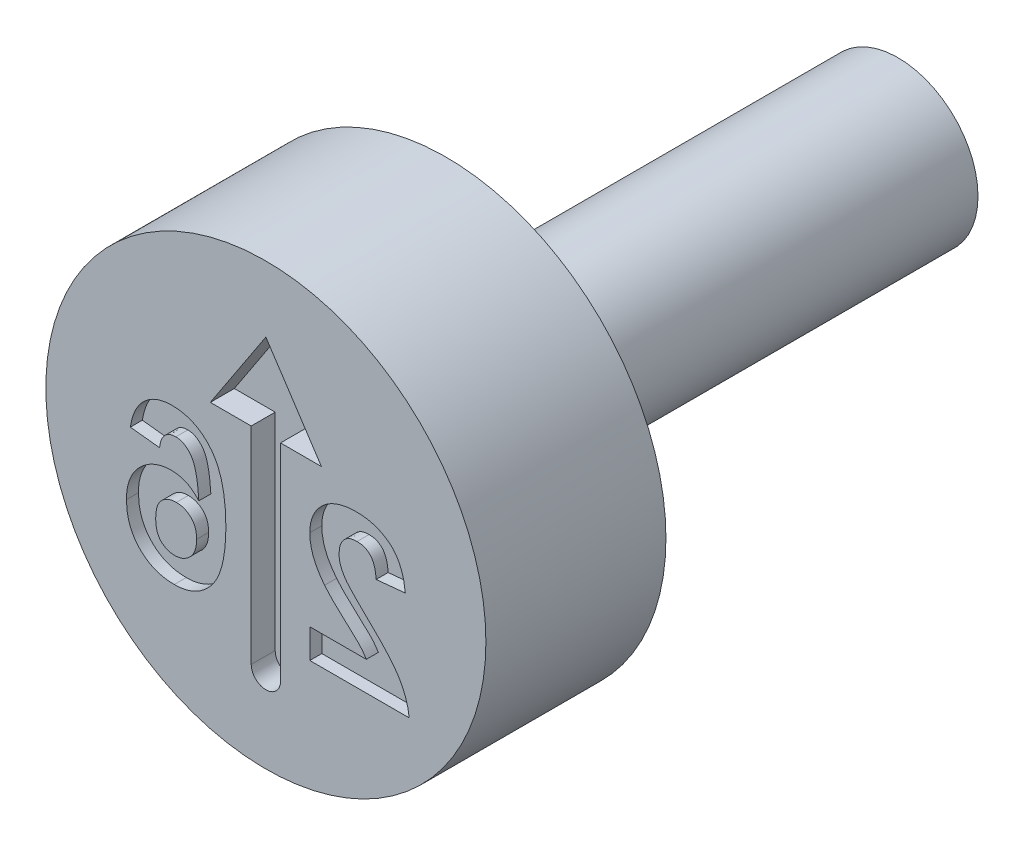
ISO-10303-21;
HEADER;
FILE_DESCRIPTION(('STEP AP214'),'2;1');
FILE_NAME('part.step','',(''),(''),'','','');
FILE_SCHEMA(('AUTOMOTIVE_DESIGN { 1 0 10303 214 1 1 1 1 }'));
ENDSEC;
DATA;
#1=APPLICATION_CONTEXT('core data for automotive mechanical design processes');
#2=APPLICATION_PROTOCOL_DEFINITION('international standard','automotive_design',2000,#1);
#3=PRODUCT_CONTEXT('',#1,'mechanical');
#4=PRODUCT('Part','Part','',(#3));
#5=PRODUCT_RELATED_PRODUCT_CATEGORY('part','',(#4));
#6=PRODUCT_DEFINITION_FORMATION('','',#4);
#7=PRODUCT_DEFINITION_CONTEXT('part definition',#1,'design');
#8=PRODUCT_DEFINITION('design','',#6,#7);
#9=PRODUCT_DEFINITION_SHAPE('','',#8);
#10=(LENGTH_UNIT() NAMED_UNIT(*) SI_UNIT(.MILLI.,.METRE.));
#11=(NAMED_UNIT(*) PLANE_ANGLE_UNIT() SI_UNIT($,.RADIAN.));
#12=(NAMED_UNIT(*) SI_UNIT($,.STERADIAN.) SOLID_ANGLE_UNIT());
#13=UNCERTAINTY_MEASURE_WITH_UNIT(LENGTH_MEASURE(1.E-05),#10,'distance_accuracy_value','');
#14=(GEOMETRIC_REPRESENTATION_CONTEXT(3) GLOBAL_UNCERTAINTY_ASSIGNED_CONTEXT((#13)) GLOBAL_UNIT_ASSIGNED_CONTEXT((#10,
#11,#12)) REPRESENTATION_CONTEXT('',''));
#15=CARTESIAN_POINT('',(0.,0.,0.));
#16=DIRECTION('',(0.,0.,1.));
#17=DIRECTION('',(1.,0.,0.));
#18=AXIS2_PLACEMENT_3D('',#15,#16,#17);
#19=CARTESIAN_POINT('',(0.,5.5,0.));
#20=DIRECTION('',(0.,0.,-1.));
#21=DIRECTION('',(-1.,0.,0.));
#22=AXIS2_PLACEMENT_3D('',#19,#20,#21);
#23=PLANE('',#22);
#24=DIRECTION('',(0.994071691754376,-0.108726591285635,0.));
#25=VECTOR('',#24,1.);
#26=CARTESIAN_POINT('',(-3.38718631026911,0.208133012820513,0.));
#27=LINE('',#26,#25);
#28=CARTESIAN_POINT('',(-3.38718631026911,0.208133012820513,0.));
#29=VERTEX_POINT('',#28);
#30=CARTESIAN_POINT('',(-2.65641707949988,0.128205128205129,0.));
#31=VERTEX_POINT('',#30);
#32=EDGE_CURVE('E334',#29,#31,#27,.T.);
#33=ORIENTED_EDGE('',*,*,#32,.F.);
#34=CARTESIAN_POINT('',(-2.34431772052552,1.2,0.));
#35=CARTESIAN_POINT('',(-2.37861373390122,1.19938299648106,0.));
#36=CARTESIAN_POINT('',(-2.44565805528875,1.19817683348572,0.));
#37=CARTESIAN_POINT('',(-2.54392115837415,1.18536838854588,0.));
#38=CARTESIAN_POINT('',(-2.63766324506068,1.16578220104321,0.));
#39=CARTESIAN_POINT('',(-2.72713000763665,1.13867037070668,0.));
#40=CARTESIAN_POINT('',(-2.81169153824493,1.10236238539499,0.));
#41=CARTESIAN_POINT('',(-2.89168363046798,1.05813085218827,0.));
#42=CARTESIAN_POINT('',(-2.96737520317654,1.00609556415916,0.));
#43=CARTESIAN_POINT('',(-3.03837242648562,0.94659154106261,0.));
#44=CARTESIAN_POINT('',(-3.10410389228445,0.879438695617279,0.));
#45=CARTESIAN_POINT('',(-3.16345788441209,0.804485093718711,0.));
#46=CARTESIAN_POINT('',(-3.21682747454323,0.722635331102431,0.));
#47=CARTESIAN_POINT('',(-3.26444623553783,0.633957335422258,0.));
#48=CARTESIAN_POINT('',(-3.30438806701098,0.537601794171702,0.));
#49=CARTESIAN_POINT('',(-3.33872466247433,0.434326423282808,0.));
#50=CARTESIAN_POINT('',(-3.36696412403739,0.323909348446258,0.));
#51=CARTESIAN_POINT('',(-3.38034280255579,0.247313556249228,0.));
#52=CARTESIAN_POINT('',(-3.38718631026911,0.208133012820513,0.));
#53=B_SPLINE_CURVE_WITH_KNOTS('',3,(#34,#35,#36,#37,#38,#39,#40,#41,#42,#43,#44,#45,#46,#47,#48,
#49,#50,#51,#52),.UNSPECIFIED.,.F.,.F.,(4,1,1,1,1,1,1,1,1,1,1,1,1,1,1,1,4),(0.,
0.0647517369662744,0.126581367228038,0.186839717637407,0.245514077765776,0.302849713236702,
0.360345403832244,0.417912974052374,0.476091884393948,0.535068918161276,0.595103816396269,
0.656390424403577,0.719434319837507,0.784953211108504,0.853160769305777,0.924888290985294,1.),.UNSPECIFIED.);
#54=CARTESIAN_POINT('',(-2.34431772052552,1.2,0.));
#55=VERTEX_POINT('',#54);
#56=EDGE_CURVE('E54',#55,#29,#53,.T.);
#57=ORIENTED_EDGE('',*,*,#56,.F.);
#58=CARTESIAN_POINT('',(-1.00000682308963,-0.751001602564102,0.));
#59=CARTESIAN_POINT('',(-1.00114297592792,-0.66774121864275,0.));
#60=CARTESIAN_POINT('',(-1.00333829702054,-0.506862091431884,0.));
#61=CARTESIAN_POINT('',(-1.02100383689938,-0.274574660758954,0.));
#62=CARTESIAN_POINT('',(-1.04906399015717,-0.0600670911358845,0.));
#63=CARTESIAN_POINT('',(-1.08994063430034,0.136176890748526,0.));
#64=CARTESIAN_POINT('',(-1.14222502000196,0.314564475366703,0.));
#65=CARTESIAN_POINT('',(-1.20561139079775,0.475454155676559,0.));
#66=CARTESIAN_POINT('',(-1.28169221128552,0.618263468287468,0.));
#67=CARTESIAN_POINT('',(-1.37014807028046,0.742527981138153,0.));
#68=CARTESIAN_POINT('',(-1.46747500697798,0.850546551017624,0.));
#69=CARTESIAN_POINT('',(-1.57205322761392,0.943784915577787,0.));
#70=CARTESIAN_POINT('',(-1.68348348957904,1.02314465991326,0.));
#71=CARTESIAN_POINT('',(-1.80176311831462,1.08842538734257,0.));
#72=CARTESIAN_POINT('',(-1.92786309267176,1.13791434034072,0.));
#73=CARTESIAN_POINT('',(-2.0605873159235,1.17365155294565,0.));
#74=CARTESIAN_POINT('',(-2.20015871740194,1.19661929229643,0.));
#75=CARTESIAN_POINT('',(-2.29576291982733,1.19886132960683,0.));
#76=CARTESIAN_POINT('',(-2.34431772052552,1.2,0.));
#77=B_SPLINE_CURVE_WITH_KNOTS('',3,(#58,#59,#60,#61,#62,#63,#64,#65,#66,#67,#68,#69,#70,#71,#72,
#73,#74,#75,#76),.UNSPECIFIED.,.F.,.F.,(4,1,1,1,1,1,1,1,1,1,1,1,1,1,1,1,4),(0.,
0.0932311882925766,0.180145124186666,0.260720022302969,0.335343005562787,0.40439372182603,
0.46866345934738,0.528671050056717,0.585123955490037,0.639046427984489,0.691174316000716,
0.741714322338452,0.79194664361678,0.84207517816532,0.893016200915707,0.945665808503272,1.),.UNSPECIFIED.);
#78=CARTESIAN_POINT('',(-1.00000682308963,-0.751001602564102,0.));
#79=VERTEX_POINT('',#78);
#80=EDGE_CURVE('E385',#79,#55,#77,.T.);
#81=ORIENTED_EDGE('',*,*,#80,.F.);
#82=CARTESIAN_POINT('',(-2.28951002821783,-2.64871794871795,0.));
#83=CARTESIAN_POINT('',(-2.24350861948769,-2.64743095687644,0.));
#84=CARTESIAN_POINT('',(-2.15306166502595,-2.64490050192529,0.));
#85=CARTESIAN_POINT('',(-2.02065737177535,-2.62407614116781,0.));
#86=CARTESIAN_POINT('',(-1.89477864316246,-2.58884461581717,0.));
#87=CARTESIAN_POINT('',(-1.77544111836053,-2.53964228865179,0.));
#88=CARTESIAN_POINT('',(-1.66165290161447,-2.47775337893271,0.));
#89=CARTESIAN_POINT('',(-1.55447059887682,-2.40087607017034,0.));
#90=CARTESIAN_POINT('',(-1.45417823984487,-2.3097434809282,0.));
#91=CARTESIAN_POINT('',(-1.35944929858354,-2.2055897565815,0.));
#92=CARTESIAN_POINT('',(-1.27324850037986,-2.08528397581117,0.));
#93=CARTESIAN_POINT('',(-1.19983916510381,-1.94623579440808,0.));
#94=CARTESIAN_POINT('',(-1.13758069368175,-1.78996806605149,0.));
#95=CARTESIAN_POINT('',(-1.08689317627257,-1.61608002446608,0.));
#96=CARTESIAN_POINT('',(-1.04776607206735,-1.42458546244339,0.));
#97=CARTESIAN_POINT('',(-1.02046406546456,-1.21546832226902,0.));
#98=CARTESIAN_POINT('',(-1.0023298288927,-0.989074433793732,0.));
#99=CARTESIAN_POINT('',(-1.00079947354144,-0.832236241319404,0.));
#100=CARTESIAN_POINT('',(-1.00000682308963,-0.751001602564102,0.));
#101=B_SPLINE_CURVE_WITH_KNOTS('',3,(#82,#83,#84,#85,#86,#87,#88,#89,#90,#91,#92,#93,#94,#95,
#96,#97,#98,#99,#100),.UNSPECIFIED.,.F.,.F.,(4,1,1,1,1,1,1,1,1,1,1,1,1,1,1,1,4),(0.,
0.0532594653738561,0.104717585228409,0.154775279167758,0.20433007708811,0.25391362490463,
0.304476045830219,0.356706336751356,0.410596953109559,0.467274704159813,0.52762561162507,
0.59224090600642,0.661798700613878,0.737130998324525,0.818387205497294,0.905933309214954,1.),.UNSPECIFIED.);
#102=CARTESIAN_POINT('',(-2.28951002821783,-2.64871794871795,0.));
#103=VERTEX_POINT('',#102);
#104=EDGE_CURVE('E377',#103,#79,#101,.T.);
#105=ORIENTED_EDGE('',*,*,#104,.F.);
#106=CARTESIAN_POINT('',(-3.48462220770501,-1.40945512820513,0.));
#107=CARTESIAN_POINT('',(-3.48356740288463,-1.45516668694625,0.));
#108=CARTESIAN_POINT('',(-3.48151028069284,-1.5443151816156,0.));
#109=CARTESIAN_POINT('',(-3.46636842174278,-1.67487526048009,0.));
#110=CARTESIAN_POINT('',(-3.43962146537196,-1.79810927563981,0.));
#111=CARTESIAN_POINT('',(-3.40307934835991,-1.91500594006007,0.));
#112=CARTESIAN_POINT('',(-3.3558131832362,-2.0246389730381,0.));
#113=CARTESIAN_POINT('',(-3.29855405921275,-2.12791186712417,0.));
#114=CARTESIAN_POINT('',(-3.22936428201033,-2.22305977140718,0.));
#115=CARTESIAN_POINT('',(-3.15138384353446,-2.31136256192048,0.));
#116=CARTESIAN_POINT('',(-3.06445108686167,-2.39016137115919,0.));
#117=CARTESIAN_POINT('',(-2.97180545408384,-2.45993864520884,0.));
#118=CARTESIAN_POINT('',(-2.8724193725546,-2.51794245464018,0.));
#119=CARTESIAN_POINT('',(-2.76776189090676,-2.56676259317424,0.));
#120=CARTESIAN_POINT('',(-2.65603544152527,-2.60259016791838,0.));
#121=CARTESIAN_POINT('',(-2.53920974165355,-2.62945904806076,0.));
#122=CARTESIAN_POINT('',(-2.41633484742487,-2.64584666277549,0.));
#123=CARTESIAN_POINT('',(-2.33244259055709,-2.64774596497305,0.));
#124=CARTESIAN_POINT('',(-2.28951002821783,-2.64871794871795,0.));
#125=B_SPLINE_CURVE_WITH_KNOTS('',3,(#106,#107,#108,#109,#110,#111,#112,#113,#114,#115,#116,
#117,#118,#119,#120,#121,#122,#123,#124),.UNSPECIFIED.,.F.,.F.,(4,1,1,1,1,1,1,1,1,1,1,1,1,1,1,1,
4),(0.,0.0708046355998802,0.138086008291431,0.203231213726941,0.265884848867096,
0.327509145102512,0.387868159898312,0.448411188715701,0.509386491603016,0.570040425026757,
0.629864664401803,0.688715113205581,0.747985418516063,0.808394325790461,0.870086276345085,
0.933515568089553,1.),.UNSPECIFIED.);
#126=CARTESIAN_POINT('',(-3.48462220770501,-1.40945512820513,0.));
#127=VERTEX_POINT('',#126);
#128=EDGE_CURVE('E369',#127,#103,#125,.T.);
#129=ORIENTED_EDGE('',*,*,#128,.F.);
#130=CARTESIAN_POINT('',(-2.36182573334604,-0.212820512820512,0.));
#131=CARTESIAN_POINT('',(-2.39967647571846,-0.213910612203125,0.));
#132=CARTESIAN_POINT('',(-2.47441824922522,-0.216063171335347,0.));
#133=CARTESIAN_POINT('',(-2.58453023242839,-0.231160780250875,0.));
#134=CARTESIAN_POINT('',(-2.69018991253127,-0.258308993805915,0.));
#135=CARTESIAN_POINT('',(-2.79187527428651,-0.295033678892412,0.));
#136=CARTESIAN_POINT('',(-2.89008889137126,-0.341279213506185,0.));
#137=CARTESIAN_POINT('',(-2.98295204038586,-0.399819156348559,0.));
#138=CARTESIAN_POINT('',(-3.07192242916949,-0.468074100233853,0.));
#139=CARTESIAN_POINT('',(-3.15577645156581,-0.546054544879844,0.));
#140=CARTESIAN_POINT('',(-3.2328181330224,-0.631904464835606,0.));
#141=CARTESIAN_POINT('',(-3.30083831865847,-0.724629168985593,0.));
#142=CARTESIAN_POINT('',(-3.35681669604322,-0.824511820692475,0.));
#143=CARTESIAN_POINT('',(-3.40467150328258,-0.929316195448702,0.));
#144=CARTESIAN_POINT('',(-3.44027730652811,-1.04111124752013,0.));
#145=CARTESIAN_POINT('',(-3.46612335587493,-1.15828824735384,0.));
#146=CARTESIAN_POINT('',(-3.48155162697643,-1.28192278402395,0.));
#147=CARTESIAN_POINT('',(-3.48358257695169,-1.36627549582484,0.));
#148=CARTESIAN_POINT('',(-3.48462220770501,-1.40945512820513,0.));
#149=B_SPLINE_CURVE_WITH_KNOTS('',3,(#130,#131,#132,#133,#134,#135,#136,#137,#138,#139,#140,
#141,#142,#143,#144,#145,#146,#147,#148),.UNSPECIFIED.,.F.,.F.,(4,1,1,1,1,1,1,1,1,1,1,1,1,1,1,1,
4),(0.,0.0619593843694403,0.12234777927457,0.181484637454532,0.240217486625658,
0.299114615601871,0.358819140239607,0.419550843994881,0.482449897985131,0.545990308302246,
0.608137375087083,0.670271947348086,0.733113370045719,0.796428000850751,0.8619364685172,
0.9293261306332,1.),.UNSPECIFIED.);
#150=CARTESIAN_POINT('',(-2.36182573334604,-0.212820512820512,0.));
#151=VERTEX_POINT('',#150);
#152=EDGE_CURVE('E361',#151,#127,#149,.T.);
#153=ORIENTED_EDGE('',*,*,#152,.F.);
#154=CARTESIAN_POINT('',(-1.67520714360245,-0.531009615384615,0.));
#155=CARTESIAN_POINT('',(-1.69856262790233,-0.505642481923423,0.));
#156=CARTESIAN_POINT('',(-1.74436027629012,-0.455900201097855,0.));
#157=CARTESIAN_POINT('',(-1.82035302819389,-0.391047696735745,0.));
#158=CARTESIAN_POINT('',(-1.89996674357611,-0.335603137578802,0.));
#159=CARTESIAN_POINT('',(-1.98406773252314,-0.29011578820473,0.));
#160=CARTESIAN_POINT('',(-2.07311504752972,-0.256265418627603,0.));
#161=CARTESIAN_POINT('',(-2.16549566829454,-0.230563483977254,0.));
#162=CARTESIAN_POINT('',(-2.26241886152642,-0.216166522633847,0.));
#163=CARTESIAN_POINT('',(-2.32828745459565,-0.213949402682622,0.));
#164=CARTESIAN_POINT('',(-2.36182573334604,-0.212820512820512,0.));
#165=B_SPLINE_CURVE_WITH_KNOTS('',3,(#154,#155,#156,#157,#158,#159,#160,#161,#162,#163,#164),
.UNSPECIFIED.,.F.,.F.,(4,1,1,1,1,1,1,1,4),(0.,0.132218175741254,0.259265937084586,
0.382426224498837,0.503963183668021,0.625109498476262,0.747226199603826,0.871295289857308,1.),.UNSPECIFIED.);
#166=CARTESIAN_POINT('',(-1.67520714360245,-0.531009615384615,0.));
#167=VERTEX_POINT('',#166);
#168=EDGE_CURVE('E353',#167,#151,#165,.T.);
#169=ORIENTED_EDGE('',*,*,#168,.F.);
#170=CARTESIAN_POINT('',(-2.25068791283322,0.566666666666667,0.));
#171=CARTESIAN_POINT('',(-2.23236038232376,0.566218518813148,0.));
#172=CARTESIAN_POINT('',(-2.19588952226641,0.565326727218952,0.));
#173=CARTESIAN_POINT('',(-2.14276528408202,0.554004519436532,0.));
#174=CARTESIAN_POINT('',(-2.09154712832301,0.537202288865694,0.));
#175=CARTESIAN_POINT('',(-2.0426530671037,0.513405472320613,0.));
#176=CARTESIAN_POINT('',(-1.99583914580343,0.48270009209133,0.));
#177=CARTESIAN_POINT('',(-1.95181704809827,0.444719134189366,0.));
#178=CARTESIAN_POINT('',(-1.90856289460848,0.40146466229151,0.));
#179=CARTESIAN_POINT('',(-1.8686225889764,0.34923285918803,0.));
#180=CARTESIAN_POINT('',(-1.83030451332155,0.287386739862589,0.));
#181=CARTESIAN_POINT('',(-1.7973111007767,0.21167542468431,0.));
#182=CARTESIAN_POINT('',(-1.76790404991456,0.122169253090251,0.));
#183=CARTESIAN_POINT('',(-1.74272532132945,0.0184298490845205,0.));
#184=CARTESIAN_POINT('',(-1.71987588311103,-0.098884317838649,0.));
#185=CARTESIAN_POINT('',(-1.70114583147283,-0.230248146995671,0.));
#186=CARTESIAN_POINT('',(-1.68615815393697,-0.375779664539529,0.));
#187=CARTESIAN_POINT('',(-1.67896798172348,-0.47769994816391,0.));
#188=CARTESIAN_POINT('',(-1.67520714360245,-0.531009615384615,0.));
#189=B_SPLINE_CURVE_WITH_KNOTS('',3,(#170,#171,#172,#173,#174,#175,#176,#177,#178,#179,#180,
#181,#182,#183,#184,#185,#186,#187,#188),.UNSPECIFIED.,.F.,.F.,(4,1,1,1,1,1,1,1,1,1,1,1,1,1,1,1,
4),(0.,0.0401536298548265,0.0799036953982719,0.118642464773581,0.158240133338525,
0.198858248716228,0.241137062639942,0.285631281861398,0.332856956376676,0.385095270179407,
0.444912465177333,0.513585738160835,0.591645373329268,0.679009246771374,0.775790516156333,
0.882726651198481,1.),.UNSPECIFIED.);
#190=CARTESIAN_POINT('',(-2.25068791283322,0.566666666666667,0.));
#191=VERTEX_POINT('',#190);
#192=EDGE_CURVE('E345',#191,#167,#189,.T.);
#193=ORIENTED_EDGE('',*,*,#192,.F.);
#194=CARTESIAN_POINT('',(-2.65641707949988,0.128205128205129,0.));
#195=CARTESIAN_POINT('',(-2.65152116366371,0.163402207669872,0.));
#196=CARTESIAN_POINT('',(-2.6423079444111,0.22963668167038,0.));
#197=CARTESIAN_POINT('',(-2.61501886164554,0.321040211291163,0.));
#198=CARTESIAN_POINT('',(-2.57702937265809,0.397933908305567,0.));
#199=CARTESIAN_POINT('',(-2.52826618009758,0.460425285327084,0.));
#200=CARTESIAN_POINT('',(-2.47018408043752,0.508521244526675,0.));
#201=CARTESIAN_POINT('',(-2.40400266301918,0.54269635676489,0.));
#202=CARTESIAN_POINT('',(-2.3297639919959,0.562983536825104,0.));
#203=CARTESIAN_POINT('',(-2.27771457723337,0.565407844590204,0.));
#204=CARTESIAN_POINT('',(-2.25068791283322,0.566666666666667,0.));
#205=B_SPLINE_CURVE_WITH_KNOTS('',3,(#194,#195,#196,#197,#198,#199,#200,#201,#202,#203,#204),
.UNSPECIFIED.,.F.,.F.,(4,1,1,1,1,1,1,1,4),(0.,0.160089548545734,0.301259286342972,
0.428171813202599,0.544692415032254,0.656041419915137,0.765564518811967,0.878269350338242,1.),.UNSPECIFIED.);
#206=EDGE_CURVE('E340',#31,#191,#205,.T.);
#207=ORIENTED_EDGE('',*,*,#206,.F.);
#208=EDGE_LOOP('',(#33,#57,#81,#105,#129,#153,#169,#193,#207));
#209=FACE_BOUND('',#208,.T.);
#210=CARTESIAN_POINT('',(0.,0.,0.));
#211=DIRECTION('',(0.,0.,1.));
#212=DIRECTION('',(1.,0.,0.));
#213=AXIS2_PLACEMENT_3D('',#210,#211,#212);
#214=CIRCLE('',#213,5.5);
#215=CARTESIAN_POINT('',(5.5,0.,0.));
#216=VERTEX_POINT('',#215);
#217=EDGE_CURVE('E47',#216,#216,#214,.T.);
#218=ORIENTED_EDGE('',*,*,#217,.T.);
#219=EDGE_LOOP('',(#218));
#220=FACE_BOUND('',#219,.T.);
#221=DIRECTION('',(0.,1.,0.));
#222=VECTOR('',#221,1.);
#223=CARTESIAN_POINT('',(0.366422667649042,1.74359356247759,0.));
#224=LINE('',#223,#222);
#225=CARTESIAN_POINT('',(0.366422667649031,-3.4168913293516,0.));
#226=VERTEX_POINT('',#225);
#227=CARTESIAN_POINT('',(0.366422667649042,1.74359356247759,0.));
#228=VERTEX_POINT('',#227);
#229=EDGE_CURVE('E527',#226,#228,#224,.T.);
#230=ORIENTED_EDGE('',*,*,#229,.F.);
#231=CARTESIAN_POINT('',(3.14387868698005E-13,-3.4168913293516,0.));
#232=DIRECTION('',(0.,0.,1.));
#233=DIRECTION('',(1.,0.,0.));
#234=AXIS2_PLACEMENT_3D('',#231,#232,#233);
#235=CIRCLE('',#234,0.366422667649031);
#236=CARTESIAN_POINT('',(-0.366422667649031,-3.4168913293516,0.));
#237=VERTEX_POINT('',#236);
#238=EDGE_CURVE('E619',#237,#226,#235,.T.);
#239=ORIENTED_EDGE('',*,*,#238,.F.);
#240=DIRECTION('',(0.,-1.,0.));
#241=VECTOR('',#240,1.);
#242=CARTESIAN_POINT('',(-0.366422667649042,1.74359356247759,0.));
#243=LINE('',#242,#241);
#244=CARTESIAN_POINT('',(-0.366422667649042,1.74359356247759,0.));
#245=VERTEX_POINT('',#244);
#246=EDGE_CURVE('E649',#245,#237,#243,.T.);
#247=ORIENTED_EDGE('',*,*,#246,.F.);
#248=DIRECTION('',(1.,0.,0.));
#249=VECTOR('',#248,1.);
#250=CARTESIAN_POINT('',(-1.38878912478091,1.74359356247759,0.));
#251=LINE('',#250,#249);
#252=CARTESIAN_POINT('',(-1.38878912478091,1.74359356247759,0.));
#253=VERTEX_POINT('',#252);
#254=EDGE_CURVE('E679',#253,#245,#251,.T.);
#255=ORIENTED_EDGE('',*,*,#254,.F.);
#256=DIRECTION('',(-0.550159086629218,-0.835059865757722,0.));
#257=VECTOR('',#256,1.);
#258=CARTESIAN_POINT('',(0.,3.85156939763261,0.));
#259=LINE('',#258,#257);
#260=CARTESIAN_POINT('',(0.,3.85156939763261,0.));
#261=VERTEX_POINT('',#260);
#262=EDGE_CURVE('E676',#261,#253,#259,.T.);
#263=ORIENTED_EDGE('',*,*,#262,.F.);
#264=DIRECTION('',(-0.550159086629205,0.835059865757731,0.));
#265=VECTOR('',#264,1.);
#266=CARTESIAN_POINT('',(0.,3.85156939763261,0.));
#267=LINE('',#266,#265);
#268=CARTESIAN_POINT('',(1.38878912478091,1.74359356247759,0.));
#269=VERTEX_POINT('',#268);
#270=EDGE_CURVE('E673',#269,#261,#267,.T.);
#271=ORIENTED_EDGE('',*,*,#270,.F.);
#272=DIRECTION('',(1.,0.,0.));
#273=VECTOR('',#272,1.);
#274=CARTESIAN_POINT('',(1.38878912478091,1.74359356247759,0.));
#275=LINE('',#274,#273);
#276=EDGE_CURVE('E670',#228,#269,#275,.T.);
#277=ORIENTED_EDGE('',*,*,#276,.F.);
#278=EDGE_LOOP('',(#230,#239,#247,#255,#263,#271,#277));
#279=FACE_BOUND('',#278,.T.);
#280=DIRECTION('',(0.,-1.,0.));
#281=VECTOR('',#280,1.);
#282=CARTESIAN_POINT('',(1.0987624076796,-1.86923076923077,0.));
#283=LINE('',#282,#281);
#284=CARTESIAN_POINT('',(1.0987624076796,-1.86923076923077,0.));
#285=VERTEX_POINT('',#284);
#286=CARTESIAN_POINT('',(1.0987624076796,-2.6,0.));
#287=VERTEX_POINT('',#286);
#288=EDGE_CURVE('E532',#285,#287,#283,.T.);
#289=ORIENTED_EDGE('',*,*,#288,.F.);
#290=DIRECTION('',(-1.,0.,0.));
#291=VECTOR('',#290,1.);
#292=CARTESIAN_POINT('',(2.5108217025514,-1.86923076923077,0.));
#293=LINE('',#292,#291);
#294=CARTESIAN_POINT('',(2.5108217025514,-1.86923076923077,0.));
#295=VERTEX_POINT('',#294);
#296=EDGE_CURVE('E399',#295,#285,#293,.T.);
#297=ORIENTED_EDGE('',*,*,#296,.F.);
#298=CARTESIAN_POINT('',(1.46719189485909,-0.786778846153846,0.));
#299=CARTESIAN_POINT('',(1.47874994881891,-0.80133624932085,0.));
#300=CARTESIAN_POINT('',(1.50350462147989,-0.832514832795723,0.));
#301=CARTESIAN_POINT('',(1.545618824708,-0.880322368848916,0.));
#302=CARTESIAN_POINT('',(1.59442556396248,-0.932543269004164,0.));
#303=CARTESIAN_POINT('',(1.64923546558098,-0.990154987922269,0.));
#304=CARTESIAN_POINT('',(1.71185900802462,-1.05111733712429,0.));
#305=CARTESIAN_POINT('',(1.78004299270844,-1.11797971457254,0.));
#306=CARTESIAN_POINT('',(1.85678771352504,-1.18732188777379,0.));
#307=CARTESIAN_POINT('',(1.93627664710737,-1.26087360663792,0.));
#308=CARTESIAN_POINT('',(2.01611109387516,-1.33246046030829,0.));
#309=CARTESIAN_POINT('',(2.08949046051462,-1.40045210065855,0.));
#310=CARTESIAN_POINT('',(2.15614334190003,-1.4606100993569,0.));
#311=CARTESIAN_POINT('',(2.21296558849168,-1.51625545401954,0.));
#312=CARTESIAN_POINT('',(2.26329947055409,-1.56359040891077,0.));
#313=CARTESIAN_POINT('',(2.30533078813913,-1.60504224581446,0.));
#314=CARTESIAN_POINT('',(2.33984604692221,-1.63960744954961,0.));
#315=CARTESIAN_POINT('',(2.3874058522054,-1.69348583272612,0.));
#316=CARTESIAN_POINT('',(2.44792030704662,-1.76635636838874,0.));
#317=CARTESIAN_POINT('',(2.49049470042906,-1.83598622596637,0.));
#318=CARTESIAN_POINT('',(2.5108217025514,-1.86923076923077,0.));
#319=B_SPLINE_CURVE_WITH_KNOTS('',3,(#298,#299,#300,#301,#302,#303,#304,#305,#306,#307,#308,
#309,#310,#311,#312,#313,#314,#315,#316,#317,#318),.UNSPECIFIED.,.F.,.F.,(4,1,1,1,1,1,1,1,1,1,1,
1,1,1,1,1,1,1,4),(0.,0.0369753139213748,0.0791925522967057,0.126700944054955,0.17918407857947,
0.23736864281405,0.300558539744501,0.369153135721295,0.443112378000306,0.516018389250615,
0.582473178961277,0.642136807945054,0.694619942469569,0.740679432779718,0.779589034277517,
0.812073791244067,0.837814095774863,0.922564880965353,1.),.UNSPECIFIED.);
#320=CARTESIAN_POINT('',(1.46719189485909,-0.786778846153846,0.));
#321=VERTEX_POINT('',#320);
#322=EDGE_CURVE('E419',#321,#295,#319,.T.);
#323=ORIENTED_EDGE('',*,*,#322,.F.);
#324=CARTESIAN_POINT('',(1.0987624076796,0.166266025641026,0.));
#325=CARTESIAN_POINT('',(1.09969211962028,0.124844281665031,0.));
#326=CARTESIAN_POINT('',(1.10153652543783,0.0426698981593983,0.));
#327=CARTESIAN_POINT('',(1.11919534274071,-0.0788083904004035,0.));
#328=CARTESIAN_POINT('',(1.14617457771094,-0.19748540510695,0.));
#329=CARTESIAN_POINT('',(1.1860477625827,-0.313651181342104,0.));
#330=CARTESIAN_POINT('',(1.23659011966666,-0.43009226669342,0.));
#331=CARTESIAN_POINT('',(1.30174043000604,-0.54707002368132,0.));
#332=CARTESIAN_POINT('',(1.37738486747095,-0.668112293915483,0.));
#333=CARTESIAN_POINT('',(1.43661148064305,-0.746371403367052,0.));
#334=CARTESIAN_POINT('',(1.46719189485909,-0.786778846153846,0.));
#335=B_SPLINE_CURVE_WITH_KNOTS('',3,(#324,#325,#326,#327,#328,#329,#330,#331,#332,#333,#334),
.UNSPECIFIED.,.F.,.F.,(4,1,1,1,1,1,1,1,4),(0.,0.119176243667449,0.236427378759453,
0.352663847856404,0.469086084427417,0.589462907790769,0.717601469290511,0.854189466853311,1.),.UNSPECIFIED.);
#336=CARTESIAN_POINT('',(1.0987624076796,0.166266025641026,0.));
#337=VERTEX_POINT('',#336);
#338=EDGE_CURVE('E599',#337,#321,#335,.T.);
#339=ORIENTED_EDGE('',*,*,#338,.F.);
#340=CARTESIAN_POINT('',(2.2649483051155,1.2,0.));
#341=CARTESIAN_POINT('',(2.22076497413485,1.19915081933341,0.));
#342=CARTESIAN_POINT('',(2.13471238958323,1.19749693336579,0.));
#343=CARTESIAN_POINT('',(2.0090908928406,1.18383912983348,0.));
#344=CARTESIAN_POINT('',(1.89107852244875,1.16002477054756,0.));
#345=CARTESIAN_POINT('',(1.77964353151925,1.12847928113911,0.));
#346=CARTESIAN_POINT('',(1.67593029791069,1.08636374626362,0.));
#347=CARTESIAN_POINT('',(1.57907458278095,1.03544781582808,0.));
#348=CARTESIAN_POINT('',(1.49060072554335,0.973799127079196,0.));
#349=CARTESIAN_POINT('',(1.40918990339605,0.904779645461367,0.));
#350=CARTESIAN_POINT('',(1.33641514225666,0.828880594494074,0.));
#351=CARTESIAN_POINT('',(1.2726710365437,0.747921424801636,0.));
#352=CARTESIAN_POINT('',(1.21926643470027,0.661958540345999,0.));
#353=CARTESIAN_POINT('',(1.17445177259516,0.572039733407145,0.));
#354=CARTESIAN_POINT('',(1.1411771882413,0.476718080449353,0.));
#355=CARTESIAN_POINT('',(1.11693187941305,0.377311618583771,0.));
#356=CARTESIAN_POINT('',(1.10085626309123,0.273356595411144,0.));
#357=CARTESIAN_POINT('',(1.09946807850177,0.202357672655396,0.));
#358=CARTESIAN_POINT('',(1.0987624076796,0.166266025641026,0.));
#359=B_SPLINE_CURVE_WITH_KNOTS('',3,(#340,#341,#342,#343,#344,#345,#346,#347,#348,#349,#350,
#351,#352,#353,#354,#355,#356,#357,#358),.UNSPECIFIED.,.F.,.F.,(4,1,1,1,1,1,1,1,1,1,1,1,1,1,1,1,
4),(0.,0.0756723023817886,0.147381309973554,0.216084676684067,0.28169803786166,
0.345459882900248,0.407485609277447,0.46873129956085,0.529782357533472,0.590032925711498,
0.648548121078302,0.70595351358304,0.763101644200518,0.820289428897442,0.878479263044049,
0.938226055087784,1.),.UNSPECIFIED.);
#360=CARTESIAN_POINT('',(2.2649483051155,1.2,0.));
#361=VERTEX_POINT('',#360);
#362=EDGE_CURVE('E591',#361,#337,#359,.T.);
#363=ORIENTED_EDGE('',*,*,#362,.F.);
#364=CARTESIAN_POINT('',(3.48594189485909,0.0536057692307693,0.));
#365=CARTESIAN_POINT('',(3.48006662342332,0.102941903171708,0.));
#366=CARTESIAN_POINT('',(3.46867541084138,0.198596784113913,0.));
#367=CARTESIAN_POINT('',(3.44024844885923,0.335990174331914,0.));
#368=CARTESIAN_POINT('',(3.40424675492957,0.462741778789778,0.));
#369=CARTESIAN_POINT('',(3.35895400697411,0.578616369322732,0.));
#370=CARTESIAN_POINT('',(3.30624220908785,0.684350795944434,0.));
#371=CARTESIAN_POINT('',(3.2434226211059,0.778358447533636,0.));
#372=CARTESIAN_POINT('',(3.17269022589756,0.861680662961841,0.));
#373=CARTESIAN_POINT('',(3.09398389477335,0.934273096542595,0.));
#374=CARTESIAN_POINT('',(3.00780398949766,0.996366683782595,0.));
#375=CARTESIAN_POINT('',(2.91737364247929,1.05179473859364,0.));
#376=CARTESIAN_POINT('',(2.82092559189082,1.09726336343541,0.));
#377=CARTESIAN_POINT('',(2.71952173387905,1.13473634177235,0.));
#378=CARTESIAN_POINT('',(2.6132078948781,1.16468444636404,0.));
#379=CARTESIAN_POINT('',(2.50149235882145,1.18448572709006,0.));
#380=CARTESIAN_POINT('',(2.38506459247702,1.19841402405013,0.));
#381=CARTESIAN_POINT('',(2.30559051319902,1.19946337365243,0.));
#382=CARTESIAN_POINT('',(2.2649483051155,1.2,0.));
#383=B_SPLINE_CURVE_WITH_KNOTS('',3,(#364,#365,#366,#367,#368,#369,#370,#371,#372,#373,#374,
#375,#376,#377,#378,#379,#380,#381,#382),.UNSPECIFIED.,.F.,.F.,(4,1,1,1,1,1,1,1,1,1,1,1,1,1,1,1,
4),(0.,0.0794357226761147,0.154013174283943,0.224141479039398,0.289934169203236,
0.352732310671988,0.412725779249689,0.470302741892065,0.527168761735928,0.583502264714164,
0.639948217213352,0.696584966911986,0.753726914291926,0.812707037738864,0.872963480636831,
0.935034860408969,1.),.UNSPECIFIED.);
#384=CARTESIAN_POINT('',(3.48594189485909,0.0536057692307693,0.));
#385=VERTEX_POINT('',#384);
#386=EDGE_CURVE('E586',#385,#361,#383,.T.);
#387=ORIENTED_EDGE('',*,*,#386,.F.);
#388=DIRECTION('',(0.995240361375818,0.0974506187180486,0.));
#389=VECTOR('',#388,1.);
#390=CARTESIAN_POINT('',(2.75517266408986,-0.0179487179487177,0.));
#391=LINE('',#390,#389);
#392=CARTESIAN_POINT('',(2.75517266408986,-0.0179487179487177,0.));
#393=VERTEX_POINT('',#392);
#394=EDGE_CURVE('E580',#393,#385,#391,.T.);
#395=ORIENTED_EDGE('',*,*,#394,.F.);
#396=CARTESIAN_POINT('',(2.28017266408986,0.566666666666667,0.));
#397=CARTESIAN_POINT('',(2.31331716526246,0.565165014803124,0.));
#398=CARTESIAN_POINT('',(2.37734518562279,0.562264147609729,0.));
#399=CARTESIAN_POINT('',(2.46834289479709,0.536922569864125,0.));
#400=CARTESIAN_POINT('',(2.54794909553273,0.493053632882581,0.));
#401=CARTESIAN_POINT('',(2.6046807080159,0.443060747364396,0.));
#402=CARTESIAN_POINT('',(2.64300560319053,0.394446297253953,0.));
#403=CARTESIAN_POINT('',(2.66911884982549,0.35208200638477,0.));
#404=CARTESIAN_POINT('',(2.69162642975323,0.303943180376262,0.));
#405=CARTESIAN_POINT('',(2.71157002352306,0.250571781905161,0.));
#406=CARTESIAN_POINT('',(2.72732320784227,0.19135638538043,0.));
#407=CARTESIAN_POINT('',(2.74000984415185,0.126747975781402,0.));
#408=CARTESIAN_POINT('',(2.75023343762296,0.0563988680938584,0.));
#409=CARTESIAN_POINT('',(2.75348472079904,0.00745900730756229,0.));
#410=CARTESIAN_POINT('',(2.75517266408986,-0.0179487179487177,0.));
#411=B_SPLINE_CURVE_WITH_KNOTS('',3,(#396,#397,#398,#399,#400,#401,#402,#403,#404,#405,#406,
#407,#408,#409,#410),.UNSPECIFIED.,.F.,.F.,(4,1,1,1,1,1,1,1,1,1,1,1,4),(0.,0.116899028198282,
0.225823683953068,0.330086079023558,0.435451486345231,0.490306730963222,0.548244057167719,
0.610766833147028,0.677675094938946,0.749188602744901,0.826858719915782,0.910111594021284,1.),.UNSPECIFIED.);
#412=CARTESIAN_POINT('',(2.28017266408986,0.566666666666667,0.));
#413=VERTEX_POINT('',#412);
#414=EDGE_CURVE('E572',#413,#393,#411,.T.);
#415=ORIENTED_EDGE('',*,*,#414,.F.);
#416=CARTESIAN_POINT('',(1.82953163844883,0.0680689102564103,0.));
#417=CARTESIAN_POINT('',(1.83090027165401,0.105982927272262,0.));
#418=CARTESIAN_POINT('',(1.8334896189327,0.177713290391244,0.));
#419=CARTESIAN_POINT('',(1.85520174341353,0.278938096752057,0.));
#420=CARTESIAN_POINT('',(1.89370467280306,0.365955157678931,0.));
#421=CARTESIAN_POINT('',(1.94671612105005,0.439031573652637,0.));
#422=CARTESIAN_POINT('',(2.01374920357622,0.496286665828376,0.));
#423=CARTESIAN_POINT('',(2.09211282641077,0.538592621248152,0.));
#424=CARTESIAN_POINT('',(2.18295410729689,0.561982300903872,0.));
#425=CARTESIAN_POINT('',(2.2468027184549,0.5650587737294,0.));
#426=CARTESIAN_POINT('',(2.28017266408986,0.566666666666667,0.));
#427=B_SPLINE_CURVE_WITH_KNOTS('',3,(#416,#417,#418,#419,#420,#421,#422,#423,#424,#425,#426),
.UNSPECIFIED.,.F.,.F.,(4,1,1,1,1,1,1,1,4),(0.,0.149140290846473,0.282161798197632,
0.404655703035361,0.521109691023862,0.634416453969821,0.748796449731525,0.868710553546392,1.),.UNSPECIFIED.);
#428=CARTESIAN_POINT('',(1.82953163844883,0.0680689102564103,0.));
#429=VERTEX_POINT('',#428);
#430=EDGE_CURVE('E564',#429,#413,#427,.T.);
#431=ORIENTED_EDGE('',*,*,#430,.F.);
#432=CARTESIAN_POINT('',(1.97416304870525,-0.371153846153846,0.));
#433=CARTESIAN_POINT('',(1.952161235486,-0.334606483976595,0.));
#434=CARTESIAN_POINT('',(1.90972228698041,-0.264110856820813,0.));
#435=CARTESIAN_POINT('',(1.86318445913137,-0.153255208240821,0.));
#436=CARTESIAN_POINT('',(1.83525072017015,-0.042422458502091,0.));
#437=CARTESIAN_POINT('',(1.8314174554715,0.0316353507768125,0.));
#438=CARTESIAN_POINT('',(1.82953163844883,0.0680689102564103,0.));
#439=B_SPLINE_CURVE_WITH_KNOTS('',3,(#432,#433,#434,#435,#436,#437,#438),.UNSPECIFIED.,.F.,.F.,
(4,1,1,1,4),(0.,0.272795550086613,0.526191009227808,0.766904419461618,1.),.UNSPECIFIED.);
#440=CARTESIAN_POINT('',(1.97416304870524,-0.371153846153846,0.));
#441=VERTEX_POINT('',#440);
#442=EDGE_CURVE('E556',#441,#429,#439,.T.);
#443=ORIENTED_EDGE('',*,*,#442,.F.);
#444=CARTESIAN_POINT('',(2.55573356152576,-0.984695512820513,0.));
#445=CARTESIAN_POINT('',(2.5181628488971,-0.948429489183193,0.));
#446=CARTESIAN_POINT('',(2.44663927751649,-0.879389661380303,0.));
#447=CARTESIAN_POINT('',(2.34478957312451,-0.780527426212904,0.));
#448=CARTESIAN_POINT('',(2.25525318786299,-0.68964493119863,0.));
#449=CARTESIAN_POINT('',(2.17615804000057,-0.609097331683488,0.));
#450=CARTESIAN_POINT('',(2.10933133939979,-0.536833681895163,0.));
#451=CARTESIAN_POINT('',(2.05389404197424,-0.473988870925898,0.));
#452=CARTESIAN_POINT('',(2.00914404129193,-0.420306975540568,0.));
#453=CARTESIAN_POINT('',(1.98490740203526,-0.386251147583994,0.));
#454=CARTESIAN_POINT('',(1.97416304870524,-0.371153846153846,0.));
#455=B_SPLINE_CURVE_WITH_KNOTS('',3,(#444,#445,#446,#447,#448,#449,#450,#451,#452,#453,#454),
.UNSPECIFIED.,.F.,.F.,(4,1,1,1,1,1,1,1,4),(0.,0.18509006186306,0.352356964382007,
0.503079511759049,0.637279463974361,0.752473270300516,0.851885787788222,0.934339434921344,1.),.UNSPECIFIED.);
#456=CARTESIAN_POINT('',(2.55573356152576,-0.984695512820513,0.));
#457=VERTEX_POINT('',#456);
#458=EDGE_CURVE('E548',#457,#441,#455,.T.);
#459=ORIENTED_EDGE('',*,*,#458,.F.);
#460=CARTESIAN_POINT('',(3.58337779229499,-2.6,0.));
#461=CARTESIAN_POINT('',(3.57496546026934,-2.53754516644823,0.));
#462=CARTESIAN_POINT('',(3.55814551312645,-2.41267051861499,0.));
#463=CARTESIAN_POINT('',(3.50614424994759,-2.23026008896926,0.));
#464=CARTESIAN_POINT('',(3.43674037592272,-2.05225867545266,0.));
#465=CARTESIAN_POINT('',(3.36141565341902,-1.90740873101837,0.));
#466=CARTESIAN_POINT('',(3.28649687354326,-1.79080951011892,0.));
#467=CARTESIAN_POINT('',(3.21852306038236,-1.69526720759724,0.));
#468=CARTESIAN_POINT('',(3.1374327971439,-1.59361429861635,0.));
#469=CARTESIAN_POINT('',(3.04440279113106,-1.48503016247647,0.));
#470=CARTESIAN_POINT('',(2.93994716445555,-1.36917536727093,0.));
#471=CARTESIAN_POINT('',(2.8232866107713,-1.2464806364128,0.));
#472=CARTESIAN_POINT('',(2.69386464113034,-1.11753334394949,0.));
#473=CARTESIAN_POINT('',(2.60281398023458,-1.02997178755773,0.));
#474=CARTESIAN_POINT('',(2.55573356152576,-0.984695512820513,0.));
#475=B_SPLINE_CURVE_WITH_KNOTS('',3,(#460,#461,#462,#463,#464,#465,#466,#467,#468,#469,#470,
#471,#472,#473,#474),.UNSPECIFIED.,.F.,.F.,(4,1,1,1,1,1,1,1,1,1,1,1,4),(0.,0.0963574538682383,
0.192660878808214,0.289454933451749,0.388479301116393,0.441921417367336,0.501521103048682,
0.567882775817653,0.640891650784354,0.72037065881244,0.806636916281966,0.900015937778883,1.),.UNSPECIFIED.);
#476=CARTESIAN_POINT('',(3.58337779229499,-2.6,0.));
#477=VERTEX_POINT('',#476);
#478=EDGE_CURVE('E539',#477,#457,#475,.T.);
#479=ORIENTED_EDGE('',*,*,#478,.F.);
#480=DIRECTION('',(1.,0.,0.));
#481=VECTOR('',#480,1.);
#482=CARTESIAN_POINT('',(1.0987624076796,-2.6,0.));
#483=LINE('',#482,#481);
#484=EDGE_CURVE('E536',#287,#477,#483,.T.);
#485=ORIENTED_EDGE('',*,*,#484,.F.);
#486=EDGE_LOOP('',(#289,#297,#323,#339,#363,#387,#395,#415,#431,#443,#459,#479,#485));
#487=FACE_BOUND('',#486,.T.);
#488=ADVANCED_FACE('F39',(#209,#220,#279,#487),#23,.F.);
#489=CARTESIAN_POINT('',(0.,2.,-4.5));
#490=DIRECTION('',(0.,0.,1.));
#491=DIRECTION('',(1.,0.,0.));
#492=AXIS2_PLACEMENT_3D('',#489,#490,#491);
#493=PLANE('',#492);
#494=CARTESIAN_POINT('',(0.,0.,-4.5));
#495=DIRECTION('',(0.,0.,1.));
#496=DIRECTION('',(1.,0.,0.));
#497=AXIS2_PLACEMENT_3D('',#494,#495,#496);
#498=CIRCLE('',#497,5.5);
#499=CARTESIAN_POINT('',(5.5,0.,-4.5));
#500=VERTEX_POINT('',#499);
#501=EDGE_CURVE('E11',#500,#500,#498,.T.);
#502=ORIENTED_EDGE('',*,*,#501,.F.);
#503=EDGE_LOOP('',(#502));
#504=FACE_BOUND('',#503,.T.);
#505=CARTESIAN_POINT('',(0.,0.,-4.5));
#506=DIRECTION('',(0.,0.,1.));
#507=DIRECTION('',(1.,0.,0.));
#508=AXIS2_PLACEMENT_3D('',#505,#506,#507);
#509=CIRCLE('',#508,2.);
#510=CARTESIAN_POINT('',(2.,0.,-4.5));
#511=VERTEX_POINT('',#510);
#512=EDGE_CURVE('E686',#511,#511,#509,.T.);
#513=ORIENTED_EDGE('',*,*,#512,.T.);
#514=EDGE_LOOP('',(#513));
#515=FACE_BOUND('',#514,.T.);
#516=ADVANCED_FACE('F41',(#504,#515),#493,.F.);
#517=CARTESIAN_POINT('',(0.,0.,-0.403888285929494));
#518=DIRECTION('',(0.,0.,1.));
#519=DIRECTION('',(1.,0.,0.));
#520=AXIS2_PLACEMENT_3D('',#517,#518,#519);
#521=CYLINDRICAL_SURFACE('',#520,5.5);
#522=ORIENTED_EDGE('',*,*,#217,.F.);
#523=EDGE_LOOP('',(#522));
#524=FACE_BOUND('',#523,.T.);
#525=ORIENTED_EDGE('',*,*,#501,.T.);
#526=EDGE_LOOP('',(#525));
#527=FACE_BOUND('',#526,.T.);
#528=ADVANCED_FACE('F499',(#524,#527),#521,.T.);
#529=CARTESIAN_POINT('',(0.,0.,-15.8));
#530=DIRECTION('',(0.,0.,1.));
#531=DIRECTION('',(1.,0.,0.));
#532=AXIS2_PLACEMENT_3D('',#529,#530,#531);
#533=PLANE('',#532);
#534=CARTESIAN_POINT('',(0.,0.,-15.8));
#535=DIRECTION('',(0.,0.,1.));
#536=DIRECTION('',(1.,0.,0.));
#537=AXIS2_PLACEMENT_3D('',#534,#535,#536);
#538=CIRCLE('',#537,2.);
#539=CARTESIAN_POINT('',(2.,0.,-15.8));
#540=VERTEX_POINT('',#539);
#541=EDGE_CURVE('E701',#540,#540,#538,.T.);
#542=ORIENTED_EDGE('',*,*,#541,.F.);
#543=EDGE_LOOP('',(#542));
#544=FACE_BOUND('',#543,.T.);
#545=ADVANCED_FACE('F495',(#544),#533,.F.);
#546=CARTESIAN_POINT('',(0.,0.,-0.403888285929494));
#547=DIRECTION('',(0.,0.,1.));
#548=DIRECTION('',(1.,0.,0.));
#549=AXIS2_PLACEMENT_3D('',#546,#547,#548);
#550=CYLINDRICAL_SURFACE('',#549,2.);
#551=ORIENTED_EDGE('',*,*,#512,.F.);
#552=EDGE_LOOP('',(#551));
#553=FACE_BOUND('',#552,.T.);
#554=ORIENTED_EDGE('',*,*,#541,.T.);
#555=EDGE_LOOP('',(#554));
#556=FACE_BOUND('',#555,.T.);
#557=ADVANCED_FACE('F491',(#553,#556),#550,.T.);
#558=CARTESIAN_POINT('',(3.14387868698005E-13,-3.4168913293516,-0.6));
#559=DIRECTION('',(0.,0.,1.));
#560=DIRECTION('',(1.,0.,0.));
#561=AXIS2_PLACEMENT_3D('',#558,#559,#560);
#562=CYLINDRICAL_SURFACE('',#561,0.366422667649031);
#563=ORIENTED_EDGE('',*,*,#238,.T.);
#564=DIRECTION('',(0.,0.,1.));
#565=VECTOR('',#564,1.);
#566=CARTESIAN_POINT('',(0.366422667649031,-3.4168913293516,-0.6));
#567=LINE('',#566,#565);
#568=CARTESIAN_POINT('',(0.366422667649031,-3.4168913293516,-0.6));
#569=VERTEX_POINT('',#568);
#570=EDGE_CURVE('E667',#569,#226,#567,.T.);
#571=ORIENTED_EDGE('',*,*,#570,.F.);
#572=CARTESIAN_POINT('',(3.14387868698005E-13,-3.4168913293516,-0.6));
#573=DIRECTION('',(0.,0.,1.));
#574=DIRECTION('',(1.,0.,0.));
#575=AXIS2_PLACEMENT_3D('',#572,#573,#574);
#576=CIRCLE('',#575,0.366422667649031);
#577=CARTESIAN_POINT('',(-0.366422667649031,-3.4168913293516,-0.6));
#578=VERTEX_POINT('',#577);
#579=EDGE_CURVE('E645',#578,#569,#576,.T.);
#580=ORIENTED_EDGE('',*,*,#579,.F.);
#581=DIRECTION('',(0.,0.,1.));
#582=VECTOR('',#581,1.);
#583=CARTESIAN_POINT('',(-0.366422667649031,-3.4168913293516,-0.6));
#584=LINE('',#583,#582);
#585=EDGE_CURVE('E684',#578,#237,#584,.T.);
#586=ORIENTED_EDGE('',*,*,#585,.T.);
#587=EDGE_LOOP('',(#563,#571,#580,#586));
#588=FACE_BOUND('',#587,.T.);
#589=ADVANCED_FACE('F469',(#588),#562,.F.);
#590=CARTESIAN_POINT('',(-0.366422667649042,1.74359356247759,-0.6));
#591=DIRECTION('',(-1.,0.,0.));
#592=DIRECTION('',(0.,-1.,0.));
#593=AXIS2_PLACEMENT_3D('',#590,#591,#592);
#594=PLANE('',#593);
#595=ORIENTED_EDGE('',*,*,#246,.T.);
#596=ORIENTED_EDGE('',*,*,#585,.F.);
#597=DIRECTION('',(0.,-1.,0.));
#598=VECTOR('',#597,1.);
#599=CARTESIAN_POINT('',(-0.366422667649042,1.74359356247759,-0.6));
#600=LINE('',#599,#598);
#601=CARTESIAN_POINT('',(-0.366422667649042,1.74359356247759,-0.6));
#602=VERTEX_POINT('',#601);
#603=EDGE_CURVE('E664',#602,#578,#600,.T.);
#604=ORIENTED_EDGE('',*,*,#603,.F.);
#605=DIRECTION('',(0.,0.,1.));
#606=VECTOR('',#605,1.);
#607=CARTESIAN_POINT('',(-0.366422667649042,1.74359356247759,-0.6));
#608=LINE('',#607,#606);
#609=EDGE_CURVE('E687',#602,#245,#608,.T.);
#610=ORIENTED_EDGE('',*,*,#609,.T.);
#611=EDGE_LOOP('',(#595,#596,#604,#610));
#612=FACE_BOUND('',#611,.T.);
#613=ADVANCED_FACE('F465',(#612),#594,.F.);
#614=CARTESIAN_POINT('',(-1.38878912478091,1.74359356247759,-0.6));
#615=DIRECTION('',(0.,-1.,0.));
#616=DIRECTION('',(0.,0.,-1.));
#617=AXIS2_PLACEMENT_3D('',#614,#615,#616);
#618=PLANE('',#617);
#619=ORIENTED_EDGE('',*,*,#254,.T.);
#620=ORIENTED_EDGE('',*,*,#609,.F.);
#621=DIRECTION('',(1.,0.,0.));
#622=VECTOR('',#621,1.);
#623=CARTESIAN_POINT('',(-1.38878912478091,1.74359356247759,-0.6));
#624=LINE('',#623,#622);
#625=CARTESIAN_POINT('',(-1.38878912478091,1.74359356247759,-0.6));
#626=VERTEX_POINT('',#625);
#627=EDGE_CURVE('E661',#626,#602,#624,.T.);
#628=ORIENTED_EDGE('',*,*,#627,.F.);
#629=DIRECTION('',(0.,0.,1.));
#630=VECTOR('',#629,1.);
#631=CARTESIAN_POINT('',(-1.38878912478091,1.74359356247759,-0.6));
#632=LINE('',#631,#630);
#633=EDGE_CURVE('E689',#626,#253,#632,.T.);
#634=ORIENTED_EDGE('',*,*,#633,.T.);
#635=EDGE_LOOP('',(#619,#620,#628,#634));
#636=FACE_BOUND('',#635,.T.);
#637=ADVANCED_FACE('F468',(#636),#618,.F.);
#638=CARTESIAN_POINT('',(0.,3.85156939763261,-0.6));
#639=DIRECTION('',(-0.835059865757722,0.550159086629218,0.));
#640=DIRECTION('',(-0.550159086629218,-0.835059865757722,0.));
#641=AXIS2_PLACEMENT_3D('',#638,#639,#640);
#642=PLANE('',#641);
#643=ORIENTED_EDGE('',*,*,#262,.T.);
#644=ORIENTED_EDGE('',*,*,#633,.F.);
#645=DIRECTION('',(-0.550159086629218,-0.835059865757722,0.));
#646=VECTOR('',#645,1.);
#647=CARTESIAN_POINT('',(0.,3.85156939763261,-0.6));
#648=LINE('',#647,#646);
#649=CARTESIAN_POINT('',(0.,3.85156939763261,-0.6));
#650=VERTEX_POINT('',#649);
#651=EDGE_CURVE('E658',#650,#626,#648,.T.);
#652=ORIENTED_EDGE('',*,*,#651,.F.);
#653=DIRECTION('',(0.,0.,1.));
#654=VECTOR('',#653,1.);
#655=CARTESIAN_POINT('',(0.,3.85156939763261,-0.6));
#656=LINE('',#655,#654);
#657=EDGE_CURVE('E691',#650,#261,#656,.T.);
#658=ORIENTED_EDGE('',*,*,#657,.T.);
#659=EDGE_LOOP('',(#643,#644,#652,#658));
#660=FACE_BOUND('',#659,.T.);
#661=ADVANCED_FACE('F473',(#660),#642,.F.);
#662=CARTESIAN_POINT('',(0.,3.85156939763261,-0.6));
#663=DIRECTION('',(0.835059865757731,0.550159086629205,0.));
#664=DIRECTION('',(-0.550159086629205,0.835059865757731,0.));
#665=AXIS2_PLACEMENT_3D('',#662,#663,#664);
#666=PLANE('',#665);
#667=ORIENTED_EDGE('',*,*,#270,.T.);
#668=ORIENTED_EDGE('',*,*,#657,.F.);
#669=DIRECTION('',(-0.550159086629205,0.835059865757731,0.));
#670=VECTOR('',#669,1.);
#671=CARTESIAN_POINT('',(0.,3.85156939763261,-0.6));
#672=LINE('',#671,#670);
#673=CARTESIAN_POINT('',(1.38878912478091,1.74359356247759,-0.6));
#674=VERTEX_POINT('',#673);
#675=EDGE_CURVE('E655',#674,#650,#672,.T.);
#676=ORIENTED_EDGE('',*,*,#675,.F.);
#677=DIRECTION('',(0.,0.,1.));
#678=VECTOR('',#677,1.);
#679=CARTESIAN_POINT('',(1.38878912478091,1.74359356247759,-0.6));
#680=LINE('',#679,#678);
#681=EDGE_CURVE('E693',#674,#269,#680,.T.);
#682=ORIENTED_EDGE('',*,*,#681,.T.);
#683=EDGE_LOOP('',(#667,#668,#676,#682));
#684=FACE_BOUND('',#683,.T.);
#685=ADVANCED_FACE('F477',(#684),#666,.F.);
#686=CARTESIAN_POINT('',(1.38878912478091,1.74359356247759,-0.6));
#687=DIRECTION('',(0.,-1.,0.));
#688=DIRECTION('',(0.,0.,-1.));
#689=AXIS2_PLACEMENT_3D('',#686,#687,#688);
#690=PLANE('',#689);
#691=ORIENTED_EDGE('',*,*,#276,.T.);
#692=ORIENTED_EDGE('',*,*,#681,.F.);
#693=DIRECTION('',(1.,0.,0.));
#694=VECTOR('',#693,1.);
#695=CARTESIAN_POINT('',(1.38878912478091,1.74359356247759,-0.6));
#696=LINE('',#695,#694);
#697=CARTESIAN_POINT('',(0.366422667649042,1.74359356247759,-0.6));
#698=VERTEX_POINT('',#697);
#699=EDGE_CURVE('E652',#698,#674,#696,.T.);
#700=ORIENTED_EDGE('',*,*,#699,.F.);
#701=DIRECTION('',(0.,0.,1.));
#702=VECTOR('',#701,1.);
#703=CARTESIAN_POINT('',(0.366422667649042,1.74359356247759,-0.6));
#704=LINE('',#703,#702);
#705=EDGE_CURVE('E695',#698,#228,#704,.T.);
#706=ORIENTED_EDGE('',*,*,#705,.T.);
#707=EDGE_LOOP('',(#691,#692,#700,#706));
#708=FACE_BOUND('',#707,.T.);
#709=ADVANCED_FACE('F481',(#708),#690,.F.);
#710=CARTESIAN_POINT('',(0.366422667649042,1.74359356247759,-0.6));
#711=DIRECTION('',(1.,0.,0.));
#712=DIRECTION('',(0.,1.,0.));
#713=AXIS2_PLACEMENT_3D('',#710,#711,#712);
#714=PLANE('',#713);
#715=ORIENTED_EDGE('',*,*,#229,.T.);
#716=ORIENTED_EDGE('',*,*,#705,.F.);
#717=DIRECTION('',(0.,1.,0.));
#718=VECTOR('',#717,1.);
#719=CARTESIAN_POINT('',(0.366422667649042,1.74359356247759,-0.6));
#720=LINE('',#719,#718);
#721=EDGE_CURVE('E648',#569,#698,#720,.T.);
#722=ORIENTED_EDGE('',*,*,#721,.F.);
#723=ORIENTED_EDGE('',*,*,#570,.T.);
#724=EDGE_LOOP('',(#715,#716,#722,#723));
#725=FACE_BOUND('',#724,.T.);
#726=ADVANCED_FACE('F463',(#725),#714,.F.);
#727=CARTESIAN_POINT('',(3.14387868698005E-13,-3.4168913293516,-0.6));
#728=DIRECTION('',(0.,0.,1.));
#729=DIRECTION('',(1.,0.,0.));
#730=AXIS2_PLACEMENT_3D('',#727,#728,#729);
#731=PLANE('',#730);
#732=ORIENTED_EDGE('',*,*,#579,.T.);
#733=ORIENTED_EDGE('',*,*,#721,.T.);
#734=ORIENTED_EDGE('',*,*,#699,.T.);
#735=ORIENTED_EDGE('',*,*,#675,.T.);
#736=ORIENTED_EDGE('',*,*,#651,.T.);
#737=ORIENTED_EDGE('',*,*,#627,.T.);
#738=ORIENTED_EDGE('',*,*,#603,.T.);
#739=EDGE_LOOP('',(#732,#733,#734,#735,#736,#737,#738));
#740=FACE_BOUND('',#739,.T.);
#741=ADVANCED_FACE('F459',(#740),#731,.T.);
#742=CARTESIAN_POINT('',(2.5108217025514,-1.86923076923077,-0.3));
#743=DIRECTION('',(0.,1.,0.));
#744=DIRECTION('',(0.,0.,1.));
#745=AXIS2_PLACEMENT_3D('',#742,#743,#744);
#746=PLANE('',#745);
#747=ORIENTED_EDGE('',*,*,#296,.T.);
#748=DIRECTION('',(0.,0.,1.));
#749=VECTOR('',#748,1.);
#750=CARTESIAN_POINT('',(1.0987624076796,-1.86923076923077,-0.3));
#751=LINE('',#750,#749);
#752=CARTESIAN_POINT('',(1.0987624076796,-1.86923076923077,-0.3));
#753=VERTEX_POINT('',#752);
#754=EDGE_CURVE('E642',#753,#285,#751,.T.);
#755=ORIENTED_EDGE('',*,*,#754,.F.);
#756=DIRECTION('',(-1.,0.,0.));
#757=VECTOR('',#756,1.);
#758=CARTESIAN_POINT('',(2.5108217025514,-1.86923076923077,-0.3));
#759=LINE('',#758,#757);
#760=CARTESIAN_POINT('',(2.5108217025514,-1.86923076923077,-0.3));
#761=VERTEX_POINT('',#760);
#762=EDGE_CURVE('E415',#761,#753,#759,.T.);
#763=ORIENTED_EDGE('',*,*,#762,.F.);
#764=DIRECTION('',(0.,0.,1.));
#765=VECTOR('',#764,1.);
#766=CARTESIAN_POINT('',(2.5108217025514,-1.86923076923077,-0.3));
#767=LINE('',#766,#765);
#768=EDGE_CURVE('E614',#761,#295,#767,.T.);
#769=ORIENTED_EDGE('',*,*,#768,.T.);
#770=EDGE_LOOP('',(#747,#755,#763,#769));
#771=FACE_BOUND('',#770,.T.);
#772=ADVANCED_FACE('F455',(#771),#746,.F.);
#773=CARTESIAN_POINT('',(1.46719189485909,-0.786778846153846,-0.3));
#774=CARTESIAN_POINT('',(1.47874994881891,-0.80133624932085,-0.3));
#775=CARTESIAN_POINT('',(1.50350462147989,-0.832514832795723,-0.3));
#776=CARTESIAN_POINT('',(1.545618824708,-0.880322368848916,-0.3));
#777=CARTESIAN_POINT('',(1.59442556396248,-0.932543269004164,-0.3));
#778=CARTESIAN_POINT('',(1.64923546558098,-0.990154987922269,-0.3));
#779=CARTESIAN_POINT('',(1.71185900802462,-1.05111733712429,-0.3));
#780=CARTESIAN_POINT('',(1.78004299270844,-1.11797971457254,-0.3));
#781=CARTESIAN_POINT('',(1.85678771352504,-1.18732188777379,-0.3));
#782=CARTESIAN_POINT('',(1.93627664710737,-1.26087360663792,-0.3));
#783=CARTESIAN_POINT('',(2.01611109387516,-1.33246046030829,-0.3));
#784=CARTESIAN_POINT('',(2.08949046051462,-1.40045210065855,-0.3));
#785=CARTESIAN_POINT('',(2.15614334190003,-1.4606100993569,-0.3));
#786=CARTESIAN_POINT('',(2.21296558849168,-1.51625545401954,-0.3));
#787=CARTESIAN_POINT('',(2.26329947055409,-1.56359040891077,-0.3));
#788=CARTESIAN_POINT('',(2.30533078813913,-1.60504224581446,-0.3));
#789=CARTESIAN_POINT('',(2.33984604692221,-1.63960744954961,-0.3));
#790=CARTESIAN_POINT('',(2.3874058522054,-1.69348583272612,-0.3));
#791=CARTESIAN_POINT('',(2.44792030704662,-1.76635636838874,-0.3));
#792=CARTESIAN_POINT('',(2.49049470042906,-1.83598622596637,-0.3));
#793=CARTESIAN_POINT('',(2.5108217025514,-1.86923076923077,-0.3));
#794=B_SPLINE_CURVE_WITH_KNOTS('',3,(#773,#774,#775,#776,#777,#778,#779,#780,#781,#782,#783,
#784,#785,#786,#787,#788,#789,#790,#791,#792,#793),.UNSPECIFIED.,.F.,.F.,(4,1,1,1,1,1,1,1,1,1,1,
1,1,1,1,1,1,1,4),(0.,0.0369753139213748,0.0791925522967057,0.126700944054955,0.17918407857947,
0.23736864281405,0.300558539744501,0.369153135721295,0.443112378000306,0.516018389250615,
0.582473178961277,0.642136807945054,0.694619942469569,0.740679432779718,0.779589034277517,
0.812073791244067,0.837814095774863,0.922564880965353,1.),.UNSPECIFIED.);
#795=DIRECTION('',(0.,0.,1.));
#796=VECTOR('',#795,1.);
#797=SURFACE_OF_LINEAR_EXTRUSION('',#794,#796);
#798=ORIENTED_EDGE('',*,*,#322,.T.);
#799=ORIENTED_EDGE('',*,*,#768,.F.);
#800=CARTESIAN_POINT('',(1.46719189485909,-0.786778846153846,-0.3));
#801=VERTEX_POINT('',#800);
#802=EDGE_CURVE('E644',#801,#761,#794,.T.);
#803=ORIENTED_EDGE('',*,*,#802,.F.);
#804=DIRECTION('',(0.,0.,1.));
#805=VECTOR('',#804,1.);
#806=CARTESIAN_POINT('',(1.46719189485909,-0.786778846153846,-0.3));
#807=LINE('',#806,#805);
#808=EDGE_CURVE('E620',#801,#321,#807,.T.);
#809=ORIENTED_EDGE('',*,*,#808,.T.);
#810=EDGE_LOOP('',(#798,#799,#803,#809));
#811=FACE_BOUND('',#810,.T.);
#812=ADVANCED_FACE('F458',(#811),#797,.F.);
#813=CARTESIAN_POINT('',(1.0987624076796,0.166266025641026,-0.3));
#814=CARTESIAN_POINT('',(1.09969211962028,0.124844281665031,-0.3));
#815=CARTESIAN_POINT('',(1.10153652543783,0.0426698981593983,-0.3));
#816=CARTESIAN_POINT('',(1.11919534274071,-0.0788083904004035,-0.3));
#817=CARTESIAN_POINT('',(1.14617457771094,-0.19748540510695,-0.3));
#818=CARTESIAN_POINT('',(1.1860477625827,-0.313651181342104,-0.3));
#819=CARTESIAN_POINT('',(1.23659011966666,-0.43009226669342,-0.3));
#820=CARTESIAN_POINT('',(1.30174043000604,-0.54707002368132,-0.3));
#821=CARTESIAN_POINT('',(1.37738486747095,-0.668112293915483,-0.3));
#822=CARTESIAN_POINT('',(1.43661148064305,-0.746371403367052,-0.3));
#823=CARTESIAN_POINT('',(1.46719189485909,-0.786778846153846,-0.3));
#824=B_SPLINE_CURVE_WITH_KNOTS('',3,(#813,#814,#815,#816,#817,#818,#819,#820,#821,#822,#823),
.UNSPECIFIED.,.F.,.F.,(4,1,1,1,1,1,1,1,4),(0.,0.119176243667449,0.236427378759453,
0.352663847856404,0.469086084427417,0.589462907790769,0.717601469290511,0.854189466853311,1.),.UNSPECIFIED.);
#825=DIRECTION('',(0.,0.,1.));
#826=VECTOR('',#825,1.);
#827=SURFACE_OF_LINEAR_EXTRUSION('',#824,#826);
#828=ORIENTED_EDGE('',*,*,#338,.T.);
#829=ORIENTED_EDGE('',*,*,#808,.F.);
#830=CARTESIAN_POINT('',(1.0987624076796,0.166266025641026,-0.3));
#831=VERTEX_POINT('',#830);
#832=EDGE_CURVE('E720',#831,#801,#824,.T.);
#833=ORIENTED_EDGE('',*,*,#832,.F.);
#834=DIRECTION('',(0.,0.,1.));
#835=VECTOR('',#834,1.);
#836=CARTESIAN_POINT('',(1.0987624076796,0.166266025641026,-0.3));
#837=LINE('',#836,#835);
#838=EDGE_CURVE('E622',#831,#337,#837,.T.);
#839=ORIENTED_EDGE('',*,*,#838,.T.);
#840=EDGE_LOOP('',(#828,#829,#833,#839));
#841=FACE_BOUND('',#840,.T.);
#842=ADVANCED_FACE('F740',(#841),#827,.F.);
#843=CARTESIAN_POINT('',(2.2649483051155,1.2,-0.3));
#844=CARTESIAN_POINT('',(2.22076497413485,1.19915081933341,-0.3));
#845=CARTESIAN_POINT('',(2.13471238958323,1.19749693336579,-0.3));
#846=CARTESIAN_POINT('',(2.0090908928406,1.18383912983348,-0.3));
#847=CARTESIAN_POINT('',(1.89107852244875,1.16002477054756,-0.3));
#848=CARTESIAN_POINT('',(1.77964353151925,1.12847928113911,-0.3));
#849=CARTESIAN_POINT('',(1.67593029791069,1.08636374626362,-0.3));
#850=CARTESIAN_POINT('',(1.57907458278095,1.03544781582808,-0.3));
#851=CARTESIAN_POINT('',(1.49060072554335,0.973799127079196,-0.3));
#852=CARTESIAN_POINT('',(1.40918990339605,0.904779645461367,-0.3));
#853=CARTESIAN_POINT('',(1.33641514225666,0.828880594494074,-0.3));
#854=CARTESIAN_POINT('',(1.2726710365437,0.747921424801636,-0.3));
#855=CARTESIAN_POINT('',(1.21926643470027,0.661958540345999,-0.3));
#856=CARTESIAN_POINT('',(1.17445177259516,0.572039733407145,-0.3));
#857=CARTESIAN_POINT('',(1.1411771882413,0.476718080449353,-0.3));
#858=CARTESIAN_POINT('',(1.11693187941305,0.377311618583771,-0.3));
#859=CARTESIAN_POINT('',(1.10085626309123,0.273356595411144,-0.3));
#860=CARTESIAN_POINT('',(1.09946807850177,0.202357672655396,-0.3));
#861=CARTESIAN_POINT('',(1.0987624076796,0.166266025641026,-0.3));
#862=B_SPLINE_CURVE_WITH_KNOTS('',3,(#843,#844,#845,#846,#847,#848,#849,#850,#851,#852,#853,
#854,#855,#856,#857,#858,#859,#860,#861),.UNSPECIFIED.,.F.,.F.,(4,1,1,1,1,1,1,1,1,1,1,1,1,1,1,1,
4),(0.,0.0756723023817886,0.147381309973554,0.216084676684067,0.28169803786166,
0.345459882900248,0.407485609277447,0.46873129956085,0.529782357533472,0.590032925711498,
0.648548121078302,0.70595351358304,0.763101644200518,0.820289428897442,0.878479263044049,
0.938226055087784,1.),.UNSPECIFIED.);
#863=DIRECTION('',(0.,0.,1.));
#864=VECTOR('',#863,1.);
#865=SURFACE_OF_LINEAR_EXTRUSION('',#862,#864);
#866=ORIENTED_EDGE('',*,*,#362,.T.);
#867=ORIENTED_EDGE('',*,*,#838,.F.);
#868=CARTESIAN_POINT('',(2.2649483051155,1.2,-0.3));
#869=VERTEX_POINT('',#868);
#870=EDGE_CURVE('E724',#869,#831,#862,.T.);
#871=ORIENTED_EDGE('',*,*,#870,.F.);
#872=DIRECTION('',(0.,0.,1.));
#873=VECTOR('',#872,1.);
#874=CARTESIAN_POINT('',(2.2649483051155,1.2,-0.3));
#875=LINE('',#874,#873);
#876=EDGE_CURVE('E624',#869,#361,#875,.T.);
#877=ORIENTED_EDGE('',*,*,#876,.T.);
#878=EDGE_LOOP('',(#866,#867,#871,#877));
#879=FACE_BOUND('',#878,.T.);
#880=ADVANCED_FACE('F745',(#879),#865,.F.);
#881=CARTESIAN_POINT('',(3.48594189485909,0.0536057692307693,-0.3));
#882=CARTESIAN_POINT('',(3.48006662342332,0.102941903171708,-0.3));
#883=CARTESIAN_POINT('',(3.46867541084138,0.198596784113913,-0.3));
#884=CARTESIAN_POINT('',(3.44024844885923,0.335990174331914,-0.3));
#885=CARTESIAN_POINT('',(3.40424675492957,0.462741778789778,-0.3));
#886=CARTESIAN_POINT('',(3.35895400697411,0.578616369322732,-0.3));
#887=CARTESIAN_POINT('',(3.30624220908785,0.684350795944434,-0.3));
#888=CARTESIAN_POINT('',(3.2434226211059,0.778358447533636,-0.3));
#889=CARTESIAN_POINT('',(3.17269022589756,0.861680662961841,-0.3));
#890=CARTESIAN_POINT('',(3.09398389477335,0.934273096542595,-0.3));
#891=CARTESIAN_POINT('',(3.00780398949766,0.996366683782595,-0.3));
#892=CARTESIAN_POINT('',(2.91737364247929,1.05179473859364,-0.3));
#893=CARTESIAN_POINT('',(2.82092559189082,1.09726336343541,-0.3));
#894=CARTESIAN_POINT('',(2.71952173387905,1.13473634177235,-0.3));
#895=CARTESIAN_POINT('',(2.6132078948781,1.16468444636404,-0.3));
#896=CARTESIAN_POINT('',(2.50149235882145,1.18448572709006,-0.3));
#897=CARTESIAN_POINT('',(2.38506459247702,1.19841402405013,-0.3));
#898=CARTESIAN_POINT('',(2.30559051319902,1.19946337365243,-0.3));
#899=CARTESIAN_POINT('',(2.2649483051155,1.2,-0.3));
#900=B_SPLINE_CURVE_WITH_KNOTS('',3,(#881,#882,#883,#884,#885,#886,#887,#888,#889,#890,#891,
#892,#893,#894,#895,#896,#897,#898,#899),.UNSPECIFIED.,.F.,.F.,(4,1,1,1,1,1,1,1,1,1,1,1,1,1,1,1,
4),(0.,0.0794357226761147,0.154013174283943,0.224141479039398,0.289934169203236,
0.352732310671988,0.412725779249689,0.470302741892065,0.527168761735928,0.583502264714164,
0.639948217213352,0.696584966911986,0.753726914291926,0.812707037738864,0.872963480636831,
0.935034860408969,1.),.UNSPECIFIED.);
#901=DIRECTION('',(0.,0.,1.));
#902=VECTOR('',#901,1.);
#903=SURFACE_OF_LINEAR_EXTRUSION('',#900,#902);
#904=ORIENTED_EDGE('',*,*,#386,.T.);
#905=ORIENTED_EDGE('',*,*,#876,.F.);
#906=CARTESIAN_POINT('',(3.48594189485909,0.0536057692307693,-0.3));
#907=VERTEX_POINT('',#906);
#908=EDGE_CURVE('E757',#907,#869,#900,.T.);
#909=ORIENTED_EDGE('',*,*,#908,.F.);
#910=DIRECTION('',(0.,0.,1.));
#911=VECTOR('',#910,1.);
#912=CARTESIAN_POINT('',(3.48594189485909,0.0536057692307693,-0.3));
#913=LINE('',#912,#911);
#914=EDGE_CURVE('E626',#907,#385,#913,.T.);
#915=ORIENTED_EDGE('',*,*,#914,.T.);
#916=EDGE_LOOP('',(#904,#905,#909,#915));
#917=FACE_BOUND('',#916,.T.);
#918=ADVANCED_FACE('F749',(#917),#903,.F.);
#919=CARTESIAN_POINT('',(2.75517266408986,-0.0179487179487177,-0.3));
#920=DIRECTION('',(0.0974506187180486,-0.995240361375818,0.));
#921=DIRECTION('',(0.995240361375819,0.0974506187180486,0.));
#922=AXIS2_PLACEMENT_3D('',#919,#920,#921);
#923=PLANE('',#922);
#924=ORIENTED_EDGE('',*,*,#394,.T.);
#925=ORIENTED_EDGE('',*,*,#914,.F.);
#926=DIRECTION('',(0.995240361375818,0.0974506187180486,0.));
#927=VECTOR('',#926,1.);
#928=CARTESIAN_POINT('',(2.75517266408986,-0.0179487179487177,-0.3));
#929=LINE('',#928,#927);
#930=CARTESIAN_POINT('',(2.75517266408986,-0.0179487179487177,-0.3));
#931=VERTEX_POINT('',#930);
#932=EDGE_CURVE('E766',#931,#907,#929,.T.);
#933=ORIENTED_EDGE('',*,*,#932,.F.);
#934=DIRECTION('',(0.,0.,1.));
#935=VECTOR('',#934,1.);
#936=CARTESIAN_POINT('',(2.75517266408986,-0.0179487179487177,-0.3));
#937=LINE('',#936,#935);
#938=EDGE_CURVE('E628',#931,#393,#937,.T.);
#939=ORIENTED_EDGE('',*,*,#938,.T.);
#940=EDGE_LOOP('',(#924,#925,#933,#939));
#941=FACE_BOUND('',#940,.T.);
#942=ADVANCED_FACE('F790',(#941),#923,.F.);
#943=CARTESIAN_POINT('',(2.28017266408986,0.566666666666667,-0.3));
#944=CARTESIAN_POINT('',(2.31331716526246,0.565165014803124,-0.3));
#945=CARTESIAN_POINT('',(2.37734518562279,0.562264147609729,-0.3));
#946=CARTESIAN_POINT('',(2.46834289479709,0.536922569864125,-0.3));
#947=CARTESIAN_POINT('',(2.54794909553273,0.493053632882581,-0.3));
#948=CARTESIAN_POINT('',(2.6046807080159,0.443060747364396,-0.3));
#949=CARTESIAN_POINT('',(2.64300560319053,0.394446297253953,-0.3));
#950=CARTESIAN_POINT('',(2.66911884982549,0.35208200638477,-0.3));
#951=CARTESIAN_POINT('',(2.69162642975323,0.303943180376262,-0.3));
#952=CARTESIAN_POINT('',(2.71157002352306,0.250571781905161,-0.3));
#953=CARTESIAN_POINT('',(2.72732320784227,0.19135638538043,-0.3));
#954=CARTESIAN_POINT('',(2.74000984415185,0.126747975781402,-0.3));
#955=CARTESIAN_POINT('',(2.75023343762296,0.0563988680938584,-0.3));
#956=CARTESIAN_POINT('',(2.75348472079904,0.00745900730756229,-0.3));
#957=CARTESIAN_POINT('',(2.75517266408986,-0.0179487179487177,-0.3));
#958=B_SPLINE_CURVE_WITH_KNOTS('',3,(#943,#944,#945,#946,#947,#948,#949,#950,#951,#952,#953,
#954,#955,#956,#957),.UNSPECIFIED.,.F.,.F.,(4,1,1,1,1,1,1,1,1,1,1,1,4),(0.,0.116899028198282,
0.225823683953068,0.330086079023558,0.435451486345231,0.490306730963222,0.548244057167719,
0.610766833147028,0.677675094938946,0.749188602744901,0.826858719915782,0.910111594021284,1.),.UNSPECIFIED.);
#959=DIRECTION('',(0.,0.,1.));
#960=VECTOR('',#959,1.);
#961=SURFACE_OF_LINEAR_EXTRUSION('',#958,#960);
#962=ORIENTED_EDGE('',*,*,#414,.T.);
#963=ORIENTED_EDGE('',*,*,#938,.F.);
#964=CARTESIAN_POINT('',(2.28017266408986,0.566666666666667,-0.3));
#965=VERTEX_POINT('',#964);
#966=EDGE_CURVE('E772',#965,#931,#958,.T.);
#967=ORIENTED_EDGE('',*,*,#966,.F.);
#968=DIRECTION('',(0.,0.,1.));
#969=VECTOR('',#968,1.);
#970=CARTESIAN_POINT('',(2.28017266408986,0.566666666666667,-0.3));
#971=LINE('',#970,#969);
#972=EDGE_CURVE('E630',#965,#413,#971,.T.);
#973=ORIENTED_EDGE('',*,*,#972,.T.);
#974=EDGE_LOOP('',(#962,#963,#967,#973));
#975=FACE_BOUND('',#974,.T.);
#976=ADVANCED_FACE('F786',(#975),#961,.F.);
#977=CARTESIAN_POINT('',(1.82953163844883,0.0680689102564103,-0.3));
#978=CARTESIAN_POINT('',(1.83090027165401,0.105982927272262,-0.3));
#979=CARTESIAN_POINT('',(1.8334896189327,0.177713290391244,-0.3));
#980=CARTESIAN_POINT('',(1.85520174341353,0.278938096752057,-0.3));
#981=CARTESIAN_POINT('',(1.89370467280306,0.365955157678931,-0.3));
#982=CARTESIAN_POINT('',(1.94671612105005,0.439031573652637,-0.3));
#983=CARTESIAN_POINT('',(2.01374920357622,0.496286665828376,-0.3));
#984=CARTESIAN_POINT('',(2.09211282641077,0.538592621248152,-0.3));
#985=CARTESIAN_POINT('',(2.18295410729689,0.561982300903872,-0.3));
#986=CARTESIAN_POINT('',(2.2468027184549,0.5650587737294,-0.3));
#987=CARTESIAN_POINT('',(2.28017266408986,0.566666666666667,-0.3));
#988=B_SPLINE_CURVE_WITH_KNOTS('',3,(#977,#978,#979,#980,#981,#982,#983,#984,#985,#986,#987),
.UNSPECIFIED.,.F.,.F.,(4,1,1,1,1,1,1,1,4),(0.,0.149140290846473,0.282161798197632,
0.404655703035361,0.521109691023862,0.634416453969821,0.748796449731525,0.868710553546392,1.),.UNSPECIFIED.);
#989=DIRECTION('',(0.,0.,1.));
#990=VECTOR('',#989,1.);
#991=SURFACE_OF_LINEAR_EXTRUSION('',#988,#990);
#992=ORIENTED_EDGE('',*,*,#430,.T.);
#993=ORIENTED_EDGE('',*,*,#972,.F.);
#994=CARTESIAN_POINT('',(1.82953163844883,0.0680689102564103,-0.3));
#995=VERTEX_POINT('',#994);
#996=EDGE_CURVE('E778',#995,#965,#988,.T.);
#997=ORIENTED_EDGE('',*,*,#996,.F.);
#998=DIRECTION('',(0.,0.,1.));
#999=VECTOR('',#998,1.);
#1000=CARTESIAN_POINT('',(1.82953163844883,0.0680689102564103,-0.3));
#1001=LINE('',#1000,#999);
#1002=EDGE_CURVE('E632',#995,#429,#1001,.T.);
#1003=ORIENTED_EDGE('',*,*,#1002,.T.);
#1004=EDGE_LOOP('',(#992,#993,#997,#1003));
#1005=FACE_BOUND('',#1004,.T.);
#1006=ADVANCED_FACE('F789',(#1005),#991,.F.);
#1007=CARTESIAN_POINT('',(1.97416304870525,-0.371153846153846,-0.3));
#1008=CARTESIAN_POINT('',(1.952161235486,-0.334606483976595,-0.3));
#1009=CARTESIAN_POINT('',(1.90972228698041,-0.264110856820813,-0.3));
#1010=CARTESIAN_POINT('',(1.86318445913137,-0.153255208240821,-0.3));
#1011=CARTESIAN_POINT('',(1.83525072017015,-0.042422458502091,-0.3));
#1012=CARTESIAN_POINT('',(1.8314174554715,0.0316353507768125,-0.3));
#1013=CARTESIAN_POINT('',(1.82953163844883,0.0680689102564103,-0.3));
#1014=B_SPLINE_CURVE_WITH_KNOTS('',3,(#1007,#1008,#1009,#1010,#1011,#1012,#1013),.UNSPECIFIED.,
.F.,.F.,(4,1,1,1,4),(0.,0.272795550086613,0.526191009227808,0.766904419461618,1.),.UNSPECIFIED.);
#1015=DIRECTION('',(0.,0.,1.));
#1016=VECTOR('',#1015,1.);
#1017=SURFACE_OF_LINEAR_EXTRUSION('',#1014,#1016);
#1018=ORIENTED_EDGE('',*,*,#442,.T.);
#1019=ORIENTED_EDGE('',*,*,#1002,.F.);
#1020=CARTESIAN_POINT('',(1.97416304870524,-0.371153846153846,-0.3));
#1021=VERTEX_POINT('',#1020);
#1022=EDGE_CURVE('E797',#1021,#995,#1014,.T.);
#1023=ORIENTED_EDGE('',*,*,#1022,.F.);
#1024=DIRECTION('',(0.,0.,1.));
#1025=VECTOR('',#1024,1.);
#1026=CARTESIAN_POINT('',(1.97416304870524,-0.371153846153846,-0.3));
#1027=LINE('',#1026,#1025);
#1028=EDGE_CURVE('E634',#1021,#441,#1027,.T.);
#1029=ORIENTED_EDGE('',*,*,#1028,.T.);
#1030=EDGE_LOOP('',(#1018,#1019,#1023,#1029));
#1031=FACE_BOUND('',#1030,.T.);
#1032=ADVANCED_FACE('F793',(#1031),#1017,.F.);
#1033=CARTESIAN_POINT('',(2.55573356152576,-0.984695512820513,-0.3));
#1034=CARTESIAN_POINT('',(2.5181628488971,-0.948429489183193,-0.3));
#1035=CARTESIAN_POINT('',(2.44663927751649,-0.879389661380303,-0.3));
#1036=CARTESIAN_POINT('',(2.34478957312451,-0.780527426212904,-0.3));
#1037=CARTESIAN_POINT('',(2.25525318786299,-0.68964493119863,-0.3));
#1038=CARTESIAN_POINT('',(2.17615804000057,-0.609097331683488,-0.3));
#1039=CARTESIAN_POINT('',(2.10933133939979,-0.536833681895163,-0.3));
#1040=CARTESIAN_POINT('',(2.05389404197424,-0.473988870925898,-0.3));
#1041=CARTESIAN_POINT('',(2.00914404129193,-0.420306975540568,-0.3));
#1042=CARTESIAN_POINT('',(1.98490740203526,-0.386251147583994,-0.3));
#1043=CARTESIAN_POINT('',(1.97416304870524,-0.371153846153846,-0.3));
#1044=B_SPLINE_CURVE_WITH_KNOTS('',3,(#1033,#1034,#1035,#1036,#1037,#1038,#1039,#1040,#1041,
#1042,#1043),.UNSPECIFIED.,.F.,.F.,(4,1,1,1,1,1,1,1,4),(0.,0.18509006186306,0.352356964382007,
0.503079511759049,0.637279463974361,0.752473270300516,0.851885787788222,0.934339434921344,1.),.UNSPECIFIED.);
#1045=DIRECTION('',(0.,0.,1.));
#1046=VECTOR('',#1045,1.);
#1047=SURFACE_OF_LINEAR_EXTRUSION('',#1044,#1046);
#1048=ORIENTED_EDGE('',*,*,#458,.T.);
#1049=ORIENTED_EDGE('',*,*,#1028,.F.);
#1050=CARTESIAN_POINT('',(2.55573356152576,-0.984695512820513,-0.3));
#1051=VERTEX_POINT('',#1050);
#1052=EDGE_CURVE('E431',#1051,#1021,#1044,.T.);
#1053=ORIENTED_EDGE('',*,*,#1052,.F.);
#1054=DIRECTION('',(0.,0.,1.));
#1055=VECTOR('',#1054,1.);
#1056=CARTESIAN_POINT('',(2.55573356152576,-0.984695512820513,-0.3));
#1057=LINE('',#1056,#1055);
#1058=EDGE_CURVE('E636',#1051,#457,#1057,.T.);
#1059=ORIENTED_EDGE('',*,*,#1058,.T.);
#1060=EDGE_LOOP('',(#1048,#1049,#1053,#1059));
#1061=FACE_BOUND('',#1060,.T.);
#1062=ADVANCED_FACE('F445',(#1061),#1047,.F.);
#1063=CARTESIAN_POINT('',(3.58337779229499,-2.6,-0.3));
#1064=CARTESIAN_POINT('',(3.57496546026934,-2.53754516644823,-0.3));
#1065=CARTESIAN_POINT('',(3.55814551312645,-2.41267051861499,-0.3));
#1066=CARTESIAN_POINT('',(3.50614424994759,-2.23026008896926,-0.3));
#1067=CARTESIAN_POINT('',(3.43674037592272,-2.05225867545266,-0.3));
#1068=CARTESIAN_POINT('',(3.36141565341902,-1.90740873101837,-0.3));
#1069=CARTESIAN_POINT('',(3.28649687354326,-1.79080951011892,-0.3));
#1070=CARTESIAN_POINT('',(3.21852306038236,-1.69526720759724,-0.3));
#1071=CARTESIAN_POINT('',(3.1374327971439,-1.59361429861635,-0.3));
#1072=CARTESIAN_POINT('',(3.04440279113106,-1.48503016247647,-0.3));
#1073=CARTESIAN_POINT('',(2.93994716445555,-1.36917536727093,-0.3));
#1074=CARTESIAN_POINT('',(2.8232866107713,-1.2464806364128,-0.3));
#1075=CARTESIAN_POINT('',(2.69386464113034,-1.11753334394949,-0.3));
#1076=CARTESIAN_POINT('',(2.60281398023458,-1.02997178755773,-0.3));
#1077=CARTESIAN_POINT('',(2.55573356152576,-0.984695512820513,-0.3));
#1078=B_SPLINE_CURVE_WITH_KNOTS('',3,(#1063,#1064,#1065,#1066,#1067,#1068,#1069,#1070,#1071,
#1072,#1073,#1074,#1075,#1076,#1077),.UNSPECIFIED.,.F.,.F.,(4,1,1,1,1,1,1,1,1,1,1,1,4),(0.,
0.0963574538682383,0.192660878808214,0.289454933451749,0.388479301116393,0.441921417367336,
0.501521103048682,0.567882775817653,0.640891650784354,0.72037065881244,0.806636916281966,
0.900015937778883,1.),.UNSPECIFIED.);
#1079=DIRECTION('',(0.,0.,1.));
#1080=VECTOR('',#1079,1.);
#1081=SURFACE_OF_LINEAR_EXTRUSION('',#1078,#1080);
#1082=ORIENTED_EDGE('',*,*,#478,.T.);
#1083=ORIENTED_EDGE('',*,*,#1058,.F.);
#1084=CARTESIAN_POINT('',(3.58337779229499,-2.6,-0.3));
#1085=VERTEX_POINT('',#1084);
#1086=EDGE_CURVE('E425',#1085,#1051,#1078,.T.);
#1087=ORIENTED_EDGE('',*,*,#1086,.F.);
#1088=DIRECTION('',(0.,0.,1.));
#1089=VECTOR('',#1088,1.);
#1090=CARTESIAN_POINT('',(3.58337779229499,-2.6,-0.3));
#1091=LINE('',#1090,#1089);
#1092=EDGE_CURVE('E638',#1085,#477,#1091,.T.);
#1093=ORIENTED_EDGE('',*,*,#1092,.T.);
#1094=EDGE_LOOP('',(#1082,#1083,#1087,#1093));
#1095=FACE_BOUND('',#1094,.T.);
#1096=ADVANCED_FACE('F440',(#1095),#1081,.F.);
#1097=CARTESIAN_POINT('',(1.0987624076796,-2.6,-0.3));
#1098=DIRECTION('',(0.,-1.,0.));
#1099=DIRECTION('',(0.,0.,-1.));
#1100=AXIS2_PLACEMENT_3D('',#1097,#1098,#1099);
#1101=PLANE('',#1100);
#1102=ORIENTED_EDGE('',*,*,#484,.T.);
#1103=ORIENTED_EDGE('',*,*,#1092,.F.);
#1104=DIRECTION('',(1.,0.,0.));
#1105=VECTOR('',#1104,1.);
#1106=CARTESIAN_POINT('',(1.0987624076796,-2.6,-0.3));
#1107=LINE('',#1106,#1105);
#1108=CARTESIAN_POINT('',(1.0987624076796,-2.6,-0.3));
#1109=VERTEX_POINT('',#1108);
#1110=EDGE_CURVE('E422',#1109,#1085,#1107,.T.);
#1111=ORIENTED_EDGE('',*,*,#1110,.F.);
#1112=DIRECTION('',(0.,0.,1.));
#1113=VECTOR('',#1112,1.);
#1114=CARTESIAN_POINT('',(1.0987624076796,-2.6,-0.3));
#1115=LINE('',#1114,#1113);
#1116=EDGE_CURVE('E640',#1109,#287,#1115,.T.);
#1117=ORIENTED_EDGE('',*,*,#1116,.T.);
#1118=EDGE_LOOP('',(#1102,#1103,#1111,#1117));
#1119=FACE_BOUND('',#1118,.T.);
#1120=ADVANCED_FACE('F444',(#1119),#1101,.F.);
#1121=CARTESIAN_POINT('',(1.0987624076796,-1.86923076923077,-0.3));
#1122=DIRECTION('',(-1.,0.,0.));
#1123=DIRECTION('',(0.,0.,1.));
#1124=AXIS2_PLACEMENT_3D('',#1121,#1122,#1123);
#1125=PLANE('',#1124);
#1126=ORIENTED_EDGE('',*,*,#288,.T.);
#1127=ORIENTED_EDGE('',*,*,#1116,.F.);
#1128=DIRECTION('',(0.,-1.,0.));
#1129=VECTOR('',#1128,1.);
#1130=CARTESIAN_POINT('',(1.0987624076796,-1.86923076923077,-0.3));
#1131=LINE('',#1130,#1129);
#1132=EDGE_CURVE('E418',#753,#1109,#1131,.T.);
#1133=ORIENTED_EDGE('',*,*,#1132,.F.);
#1134=ORIENTED_EDGE('',*,*,#754,.T.);
#1135=EDGE_LOOP('',(#1126,#1127,#1133,#1134));
#1136=FACE_BOUND('',#1135,.T.);
#1137=ADVANCED_FACE('F450',(#1136),#1125,.F.);
#1138=CARTESIAN_POINT('',(3.22206611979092,-1.70186380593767,-0.3));
#1139=DIRECTION('',(0.,0.,-1.));
#1140=DIRECTION('',(-1.,0.,0.));
#1141=AXIS2_PLACEMENT_3D('',#1138,#1139,#1140);
#1142=PLANE('',#1141);
#1143=ORIENTED_EDGE('',*,*,#762,.T.);
#1144=ORIENTED_EDGE('',*,*,#1132,.T.);
#1145=ORIENTED_EDGE('',*,*,#1110,.T.);
#1146=ORIENTED_EDGE('',*,*,#1086,.T.);
#1147=ORIENTED_EDGE('',*,*,#1052,.T.);
#1148=ORIENTED_EDGE('',*,*,#1022,.T.);
#1149=ORIENTED_EDGE('',*,*,#996,.T.);
#1150=ORIENTED_EDGE('',*,*,#966,.T.);
#1151=ORIENTED_EDGE('',*,*,#932,.T.);
#1152=ORIENTED_EDGE('',*,*,#908,.T.);
#1153=ORIENTED_EDGE('',*,*,#870,.T.);
#1154=ORIENTED_EDGE('',*,*,#832,.T.);
#1155=ORIENTED_EDGE('',*,*,#802,.T.);
#1156=EDGE_LOOP('',(#1143,#1144,#1145,#1146,#1147,#1148,#1149,#1150,#1151,#1152,#1153,#1154,#1155));
#1157=FACE_BOUND('',#1156,.T.);
#1158=ADVANCED_FACE('F306',(#1157),#1142,.F.);
#1159=CARTESIAN_POINT('',(-3.06438138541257,0.919400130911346,-0.3));
#1160=DIRECTION('',(0.,0.,-1.));
#1161=DIRECTION('',(-1.,0.,0.));
#1162=AXIS2_PLACEMENT_3D('',#1159,#1160,#1161);
#1163=PLANE('',#1162);
#1164=CARTESIAN_POINT('',(-2.34431772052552,1.2,-0.3));
#1165=CARTESIAN_POINT('',(-2.37861373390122,1.19938299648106,-0.3));
#1166=CARTESIAN_POINT('',(-2.44565805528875,1.19817683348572,-0.3));
#1167=CARTESIAN_POINT('',(-2.54392115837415,1.18536838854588,-0.3));
#1168=CARTESIAN_POINT('',(-2.63766324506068,1.16578220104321,-0.3));
#1169=CARTESIAN_POINT('',(-2.72713000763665,1.13867037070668,-0.3));
#1170=CARTESIAN_POINT('',(-2.81169153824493,1.10236238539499,-0.3));
#1171=CARTESIAN_POINT('',(-2.89168363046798,1.05813085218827,-0.3));
#1172=CARTESIAN_POINT('',(-2.96737520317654,1.00609556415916,-0.3));
#1173=CARTESIAN_POINT('',(-3.03837242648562,0.94659154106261,-0.3));
#1174=CARTESIAN_POINT('',(-3.10410389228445,0.879438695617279,-0.3));
#1175=CARTESIAN_POINT('',(-3.16345788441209,0.804485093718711,-0.3));
#1176=CARTESIAN_POINT('',(-3.21682747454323,0.722635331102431,-0.3));
#1177=CARTESIAN_POINT('',(-3.26444623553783,0.633957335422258,-0.3));
#1178=CARTESIAN_POINT('',(-3.30438806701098,0.537601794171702,-0.3));
#1179=CARTESIAN_POINT('',(-3.33872466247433,0.434326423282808,-0.3));
#1180=CARTESIAN_POINT('',(-3.36696412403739,0.323909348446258,-0.3));
#1181=CARTESIAN_POINT('',(-3.38034280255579,0.247313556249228,-0.3));
#1182=CARTESIAN_POINT('',(-3.38718631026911,0.208133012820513,-0.3));
#1183=B_SPLINE_CURVE_WITH_KNOTS('',3,(#1164,#1165,#1166,#1167,#1168,#1169,#1170,#1171,#1172,
#1173,#1174,#1175,#1176,#1177,#1178,#1179,#1180,#1181,#1182),.UNSPECIFIED.,.F.,.F.,(4,1,1,1,1,1,
1,1,1,1,1,1,1,1,1,1,4),(0.,0.0647517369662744,0.126581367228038,0.186839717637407,
0.245514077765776,0.302849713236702,0.360345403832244,0.417912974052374,0.476091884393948,
0.535068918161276,0.595103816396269,0.656390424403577,0.719434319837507,0.784953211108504,
0.853160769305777,0.924888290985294,1.),.UNSPECIFIED.);
#1184=CARTESIAN_POINT('',(-2.34431772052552,1.2,-0.3));
#1185=VERTEX_POINT('',#1184);
#1186=CARTESIAN_POINT('',(-3.38718631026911,0.208133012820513,-0.3));
#1187=VERTEX_POINT('',#1186);
#1188=EDGE_CURVE('E393',#1185,#1187,#1183,.T.);
#1189=ORIENTED_EDGE('',*,*,#1188,.T.);
#1190=DIRECTION('',(0.994071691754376,-0.108726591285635,0.));
#1191=VECTOR('',#1190,1.);
#1192=CARTESIAN_POINT('',(-3.38718631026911,0.208133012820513,-0.3));
#1193=LINE('',#1192,#1191);
#1194=CARTESIAN_POINT('',(-2.65641707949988,0.128205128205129,-0.3));
#1195=VERTEX_POINT('',#1194);
#1196=EDGE_CURVE('E1248',#1187,#1195,#1193,.T.);
#1197=ORIENTED_EDGE('',*,*,#1196,.T.);
#1198=CARTESIAN_POINT('',(-2.65641707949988,0.128205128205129,-0.3));
#1199=CARTESIAN_POINT('',(-2.65152116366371,0.163402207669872,-0.3));
#1200=CARTESIAN_POINT('',(-2.6423079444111,0.22963668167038,-0.3));
#1201=CARTESIAN_POINT('',(-2.61501886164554,0.321040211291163,-0.3));
#1202=CARTESIAN_POINT('',(-2.57702937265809,0.397933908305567,-0.3));
#1203=CARTESIAN_POINT('',(-2.52826618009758,0.460425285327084,-0.3));
#1204=CARTESIAN_POINT('',(-2.47018408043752,0.508521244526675,-0.3));
#1205=CARTESIAN_POINT('',(-2.40400266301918,0.54269635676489,-0.3));
#1206=CARTESIAN_POINT('',(-2.3297639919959,0.562983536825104,-0.3));
#1207=CARTESIAN_POINT('',(-2.27771457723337,0.565407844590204,-0.3));
#1208=CARTESIAN_POINT('',(-2.25068791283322,0.566666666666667,-0.3));
#1209=B_SPLINE_CURVE_WITH_KNOTS('',3,(#1198,#1199,#1200,#1201,#1202,#1203,#1204,#1205,#1206,
#1207,#1208),.UNSPECIFIED.,.F.,.F.,(4,1,1,1,1,1,1,1,4),(0.,0.160089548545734,0.301259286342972,
0.428171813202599,0.544692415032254,0.656041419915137,0.765564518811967,0.878269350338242,1.),.UNSPECIFIED.);
#1210=CARTESIAN_POINT('',(-2.25068791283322,0.566666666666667,-0.3));
#1211=VERTEX_POINT('',#1210);
#1212=EDGE_CURVE('E1254',#1195,#1211,#1209,.T.);
#1213=ORIENTED_EDGE('',*,*,#1212,.T.);
#1214=CARTESIAN_POINT('',(-2.25068791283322,0.566666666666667,-0.3));
#1215=CARTESIAN_POINT('',(-2.23236038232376,0.566218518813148,-0.3));
#1216=CARTESIAN_POINT('',(-2.19588952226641,0.565326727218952,-0.3));
#1217=CARTESIAN_POINT('',(-2.14276528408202,0.554004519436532,-0.3));
#1218=CARTESIAN_POINT('',(-2.09154712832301,0.537202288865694,-0.3));
#1219=CARTESIAN_POINT('',(-2.0426530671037,0.513405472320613,-0.3));
#1220=CARTESIAN_POINT('',(-1.99583914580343,0.48270009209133,-0.3));
#1221=CARTESIAN_POINT('',(-1.95181704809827,0.444719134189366,-0.3));
#1222=CARTESIAN_POINT('',(-1.90856289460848,0.40146466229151,-0.3));
#1223=CARTESIAN_POINT('',(-1.8686225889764,0.34923285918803,-0.3));
#1224=CARTESIAN_POINT('',(-1.83030451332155,0.287386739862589,-0.3));
#1225=CARTESIAN_POINT('',(-1.7973111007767,0.21167542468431,-0.3));
#1226=CARTESIAN_POINT('',(-1.76790404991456,0.122169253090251,-0.3));
#1227=CARTESIAN_POINT('',(-1.74272532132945,0.0184298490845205,-0.3));
#1228=CARTESIAN_POINT('',(-1.71987588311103,-0.098884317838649,-0.3));
#1229=CARTESIAN_POINT('',(-1.70114583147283,-0.230248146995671,-0.3));
#1230=CARTESIAN_POINT('',(-1.68615815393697,-0.375779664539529,-0.3));
#1231=CARTESIAN_POINT('',(-1.67896798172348,-0.47769994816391,-0.3));
#1232=CARTESIAN_POINT('',(-1.67520714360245,-0.531009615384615,-0.3));
#1233=B_SPLINE_CURVE_WITH_KNOTS('',3,(#1214,#1215,#1216,#1217,#1218,#1219,#1220,#1221,#1222,
#1223,#1224,#1225,#1226,#1227,#1228,#1229,#1230,#1231,#1232),.UNSPECIFIED.,.F.,.F.,(4,1,1,1,1,1,
1,1,1,1,1,1,1,1,1,1,4),(0.,0.0401536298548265,0.0799036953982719,0.118642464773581,
0.158240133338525,0.198858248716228,0.241137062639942,0.285631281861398,0.332856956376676,
0.385095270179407,0.444912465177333,0.513585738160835,0.591645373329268,0.679009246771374,
0.775790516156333,0.882726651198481,1.),.UNSPECIFIED.);
#1234=CARTESIAN_POINT('',(-1.67520714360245,-0.531009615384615,-0.3));
#1235=VERTEX_POINT('',#1234);
#1236=EDGE_CURVE('E1259',#1211,#1235,#1233,.T.);
#1237=ORIENTED_EDGE('',*,*,#1236,.T.);
#1238=CARTESIAN_POINT('',(-1.67520714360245,-0.531009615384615,-0.3));
#1239=CARTESIAN_POINT('',(-1.69856262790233,-0.505642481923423,-0.3));
#1240=CARTESIAN_POINT('',(-1.74436027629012,-0.455900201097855,-0.3));
#1241=CARTESIAN_POINT('',(-1.82035302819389,-0.391047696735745,-0.3));
#1242=CARTESIAN_POINT('',(-1.89996674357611,-0.335603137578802,-0.3));
#1243=CARTESIAN_POINT('',(-1.98406773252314,-0.29011578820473,-0.3));
#1244=CARTESIAN_POINT('',(-2.07311504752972,-0.256265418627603,-0.3));
#1245=CARTESIAN_POINT('',(-2.16549566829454,-0.230563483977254,-0.3));
#1246=CARTESIAN_POINT('',(-2.26241886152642,-0.216166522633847,-0.3));
#1247=CARTESIAN_POINT('',(-2.32828745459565,-0.213949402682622,-0.3));
#1248=CARTESIAN_POINT('',(-2.36182573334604,-0.212820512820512,-0.3));
#1249=B_SPLINE_CURVE_WITH_KNOTS('',3,(#1238,#1239,#1240,#1241,#1242,#1243,#1244,#1245,#1246,
#1247,#1248),.UNSPECIFIED.,.F.,.F.,(4,1,1,1,1,1,1,1,4),(0.,0.132218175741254,0.259265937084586,
0.382426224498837,0.503963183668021,0.625109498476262,0.747226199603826,0.871295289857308,1.),.UNSPECIFIED.);
#1250=CARTESIAN_POINT('',(-2.36182573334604,-0.212820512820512,-0.3));
#1251=VERTEX_POINT('',#1250);
#1252=EDGE_CURVE('E1268',#1235,#1251,#1249,.T.);
#1253=ORIENTED_EDGE('',*,*,#1252,.T.);
#1254=CARTESIAN_POINT('',(-2.36182573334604,-0.212820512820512,-0.3));
#1255=CARTESIAN_POINT('',(-2.39967647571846,-0.213910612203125,-0.3));
#1256=CARTESIAN_POINT('',(-2.47441824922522,-0.216063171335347,-0.3));
#1257=CARTESIAN_POINT('',(-2.58453023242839,-0.231160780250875,-0.3));
#1258=CARTESIAN_POINT('',(-2.69018991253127,-0.258308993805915,-0.3));
#1259=CARTESIAN_POINT('',(-2.79187527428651,-0.295033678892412,-0.3));
#1260=CARTESIAN_POINT('',(-2.89008889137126,-0.341279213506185,-0.3));
#1261=CARTESIAN_POINT('',(-2.98295204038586,-0.399819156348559,-0.3));
#1262=CARTESIAN_POINT('',(-3.07192242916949,-0.468074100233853,-0.3));
#1263=CARTESIAN_POINT('',(-3.15577645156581,-0.546054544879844,-0.3));
#1264=CARTESIAN_POINT('',(-3.2328181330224,-0.631904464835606,-0.3));
#1265=CARTESIAN_POINT('',(-3.30083831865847,-0.724629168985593,-0.3));
#1266=CARTESIAN_POINT('',(-3.35681669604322,-0.824511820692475,-0.3));
#1267=CARTESIAN_POINT('',(-3.40467150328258,-0.929316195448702,-0.3));
#1268=CARTESIAN_POINT('',(-3.44027730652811,-1.04111124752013,-0.3));
#1269=CARTESIAN_POINT('',(-3.46612335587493,-1.15828824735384,-0.3));
#1270=CARTESIAN_POINT('',(-3.48155162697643,-1.28192278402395,-0.3));
#1271=CARTESIAN_POINT('',(-3.48358257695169,-1.36627549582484,-0.3));
#1272=CARTESIAN_POINT('',(-3.48462220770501,-1.40945512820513,-0.3));
#1273=B_SPLINE_CURVE_WITH_KNOTS('',3,(#1254,#1255,#1256,#1257,#1258,#1259,#1260,#1261,#1262,
#1263,#1264,#1265,#1266,#1267,#1268,#1269,#1270,#1271,#1272),.UNSPECIFIED.,.F.,.F.,(4,1,1,1,1,1,
1,1,1,1,1,1,1,1,1,1,4),(0.,0.0619593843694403,0.12234777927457,0.181484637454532,
0.240217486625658,0.299114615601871,0.358819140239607,0.419550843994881,0.482449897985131,
0.545990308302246,0.608137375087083,0.670271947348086,0.733113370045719,0.796428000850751,
0.8619364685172,0.9293261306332,1.),.UNSPECIFIED.);
#1274=CARTESIAN_POINT('',(-3.48462220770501,-1.40945512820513,-0.3));
#1275=VERTEX_POINT('',#1274);
#1276=EDGE_CURVE('E1277',#1251,#1275,#1273,.T.);
#1277=ORIENTED_EDGE('',*,*,#1276,.T.);
#1278=CARTESIAN_POINT('',(-3.48462220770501,-1.40945512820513,-0.3));
#1279=CARTESIAN_POINT('',(-3.48356740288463,-1.45516668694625,-0.3));
#1280=CARTESIAN_POINT('',(-3.48151028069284,-1.5443151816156,-0.3));
#1281=CARTESIAN_POINT('',(-3.46636842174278,-1.67487526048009,-0.3));
#1282=CARTESIAN_POINT('',(-3.43962146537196,-1.79810927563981,-0.3));
#1283=CARTESIAN_POINT('',(-3.40307934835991,-1.91500594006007,-0.3));
#1284=CARTESIAN_POINT('',(-3.3558131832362,-2.0246389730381,-0.3));
#1285=CARTESIAN_POINT('',(-3.29855405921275,-2.12791186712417,-0.3));
#1286=CARTESIAN_POINT('',(-3.22936428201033,-2.22305977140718,-0.3));
#1287=CARTESIAN_POINT('',(-3.15138384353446,-2.31136256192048,-0.3));
#1288=CARTESIAN_POINT('',(-3.06445108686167,-2.39016137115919,-0.3));
#1289=CARTESIAN_POINT('',(-2.97180545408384,-2.45993864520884,-0.3));
#1290=CARTESIAN_POINT('',(-2.8724193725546,-2.51794245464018,-0.3));
#1291=CARTESIAN_POINT('',(-2.76776189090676,-2.56676259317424,-0.3));
#1292=CARTESIAN_POINT('',(-2.65603544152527,-2.60259016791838,-0.3));
#1293=CARTESIAN_POINT('',(-2.53920974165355,-2.62945904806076,-0.3));
#1294=CARTESIAN_POINT('',(-2.41633484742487,-2.64584666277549,-0.3));
#1295=CARTESIAN_POINT('',(-2.33244259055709,-2.64774596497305,-0.3));
#1296=CARTESIAN_POINT('',(-2.28951002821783,-2.64871794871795,-0.3));
#1297=B_SPLINE_CURVE_WITH_KNOTS('',3,(#1278,#1279,#1280,#1281,#1282,#1283,#1284,#1285,#1286,
#1287,#1288,#1289,#1290,#1291,#1292,#1293,#1294,#1295,#1296),.UNSPECIFIED.,.F.,.F.,(4,1,1,1,1,1,
1,1,1,1,1,1,1,1,1,1,4),(0.,0.0708046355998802,0.138086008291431,0.203231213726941,
0.265884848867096,0.327509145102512,0.387868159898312,0.448411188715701,0.509386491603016,
0.570040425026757,0.629864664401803,0.688715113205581,0.747985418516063,0.808394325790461,
0.870086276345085,0.933515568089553,1.),.UNSPECIFIED.);
#1298=CARTESIAN_POINT('',(-2.28951002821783,-2.64871794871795,-0.3));
#1299=VERTEX_POINT('',#1298);
#1300=EDGE_CURVE('E1284',#1275,#1299,#1297,.T.);
#1301=ORIENTED_EDGE('',*,*,#1300,.T.);
#1302=CARTESIAN_POINT('',(-2.28951002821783,-2.64871794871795,-0.3));
#1303=CARTESIAN_POINT('',(-2.24350861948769,-2.64743095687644,-0.3));
#1304=CARTESIAN_POINT('',(-2.15306166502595,-2.64490050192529,-0.3));
#1305=CARTESIAN_POINT('',(-2.02065737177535,-2.62407614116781,-0.3));
#1306=CARTESIAN_POINT('',(-1.89477864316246,-2.58884461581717,-0.3));
#1307=CARTESIAN_POINT('',(-1.77544111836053,-2.53964228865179,-0.3));
#1308=CARTESIAN_POINT('',(-1.66165290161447,-2.47775337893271,-0.3));
#1309=CARTESIAN_POINT('',(-1.55447059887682,-2.40087607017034,-0.3));
#1310=CARTESIAN_POINT('',(-1.45417823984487,-2.3097434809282,-0.3));
#1311=CARTESIAN_POINT('',(-1.35944929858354,-2.2055897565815,-0.3));
#1312=CARTESIAN_POINT('',(-1.27324850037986,-2.08528397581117,-0.3));
#1313=CARTESIAN_POINT('',(-1.19983916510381,-1.94623579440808,-0.3));
#1314=CARTESIAN_POINT('',(-1.13758069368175,-1.78996806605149,-0.3));
#1315=CARTESIAN_POINT('',(-1.08689317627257,-1.61608002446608,-0.3));
#1316=CARTESIAN_POINT('',(-1.04776607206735,-1.42458546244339,-0.3));
#1317=CARTESIAN_POINT('',(-1.02046406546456,-1.21546832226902,-0.3));
#1318=CARTESIAN_POINT('',(-1.0023298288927,-0.989074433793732,-0.3));
#1319=CARTESIAN_POINT('',(-1.00079947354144,-0.832236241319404,-0.3));
#1320=CARTESIAN_POINT('',(-1.00000682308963,-0.751001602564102,-0.3));
#1321=B_SPLINE_CURVE_WITH_KNOTS('',3,(#1302,#1303,#1304,#1305,#1306,#1307,#1308,#1309,#1310,
#1311,#1312,#1313,#1314,#1315,#1316,#1317,#1318,#1319,#1320),.UNSPECIFIED.,.F.,.F.,(4,1,1,1,1,1,
1,1,1,1,1,1,1,1,1,1,4),(0.,0.0532594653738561,0.104717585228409,0.154775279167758,
0.20433007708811,0.25391362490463,0.304476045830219,0.356706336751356,0.410596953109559,
0.467274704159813,0.52762561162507,0.59224090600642,0.661798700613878,0.737130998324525,
0.818387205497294,0.905933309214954,1.),.UNSPECIFIED.);
#1322=CARTESIAN_POINT('',(-1.00000682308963,-0.751001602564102,-0.3));
#1323=VERTEX_POINT('',#1322);
#1324=EDGE_CURVE('E323',#1299,#1323,#1321,.T.);
#1325=ORIENTED_EDGE('',*,*,#1324,.T.);
#1326=CARTESIAN_POINT('',(-1.00000682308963,-0.751001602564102,-0.3));
#1327=CARTESIAN_POINT('',(-1.00114297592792,-0.66774121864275,-0.3));
#1328=CARTESIAN_POINT('',(-1.00333829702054,-0.506862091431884,-0.3));
#1329=CARTESIAN_POINT('',(-1.02100383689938,-0.274574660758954,-0.3));
#1330=CARTESIAN_POINT('',(-1.04906399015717,-0.0600670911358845,-0.3));
#1331=CARTESIAN_POINT('',(-1.08994063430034,0.136176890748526,-0.3));
#1332=CARTESIAN_POINT('',(-1.14222502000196,0.314564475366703,-0.3));
#1333=CARTESIAN_POINT('',(-1.20561139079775,0.475454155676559,-0.3));
#1334=CARTESIAN_POINT('',(-1.28169221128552,0.618263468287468,-0.3));
#1335=CARTESIAN_POINT('',(-1.37014807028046,0.742527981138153,-0.3));
#1336=CARTESIAN_POINT('',(-1.46747500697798,0.850546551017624,-0.3));
#1337=CARTESIAN_POINT('',(-1.57205322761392,0.943784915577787,-0.3));
#1338=CARTESIAN_POINT('',(-1.68348348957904,1.02314465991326,-0.3));
#1339=CARTESIAN_POINT('',(-1.80176311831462,1.08842538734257,-0.3));
#1340=CARTESIAN_POINT('',(-1.92786309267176,1.13791434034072,-0.3));
#1341=CARTESIAN_POINT('',(-2.0605873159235,1.17365155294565,-0.3));
#1342=CARTESIAN_POINT('',(-2.20015871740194,1.19661929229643,-0.3));
#1343=CARTESIAN_POINT('',(-2.29576291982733,1.19886132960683,-0.3));
#1344=CARTESIAN_POINT('',(-2.34431772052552,1.2,-0.3));
#1345=B_SPLINE_CURVE_WITH_KNOTS('',3,(#1326,#1327,#1328,#1329,#1330,#1331,#1332,#1333,#1334,
#1335,#1336,#1337,#1338,#1339,#1340,#1341,#1342,#1343,#1344),.UNSPECIFIED.,.F.,.F.,(4,1,1,1,1,1,
1,1,1,1,1,1,1,1,1,1,4),(0.,0.0932311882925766,0.180145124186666,0.260720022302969,
0.335343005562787,0.40439372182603,0.46866345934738,0.528671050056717,0.585123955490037,
0.639046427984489,0.691174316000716,0.741714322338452,0.79194664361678,0.84207517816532,
0.893016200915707,0.945665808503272,1.),.UNSPECIFIED.);
#1346=EDGE_CURVE('E316',#1323,#1185,#1345,.T.);
#1347=ORIENTED_EDGE('',*,*,#1346,.T.);
#1348=EDGE_LOOP('',(#1189,#1197,#1213,#1237,#1253,#1277,#1301,#1325,#1347));
#1349=FACE_BOUND('',#1348,.T.);
#1350=CARTESIAN_POINT('',(-1.73077605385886,-1.39270833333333,-0.3));
#1351=CARTESIAN_POINT('',(-1.73105351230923,-1.41684286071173,-0.3));
#1352=CARTESIAN_POINT('',(-1.73159565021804,-1.46400034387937,-0.3));
#1353=CARTESIAN_POINT('',(-1.74048572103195,-1.53242928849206,-0.3));
#1354=CARTESIAN_POINT('',(-1.75326443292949,-1.59658019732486,-0.3));
#1355=CARTESIAN_POINT('',(-1.77047664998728,-1.65680930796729,-0.3));
#1356=CARTESIAN_POINT('',(-1.79433394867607,-1.71220508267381,-0.3));
#1357=CARTESIAN_POINT('',(-1.82263853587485,-1.76387862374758,-0.3));
#1358=CARTESIAN_POINT('',(-1.85611894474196,-1.811361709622,-0.3));
#1359=CARTESIAN_POINT('',(-1.90749058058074,-1.86707323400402,-0.3));
#1360=CARTESIAN_POINT('',(-1.97847638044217,-1.92558721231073,-0.3));
#1361=CARTESIAN_POINT('',(-2.07163482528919,-1.97769370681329,-0.3));
#1362=CARTESIAN_POINT('',(-2.1714515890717,-2.01008382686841,-0.3));
#1363=CARTESIAN_POINT('',(-2.24030187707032,-2.01360677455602,-0.3));
#1364=CARTESIAN_POINT('',(-2.27504688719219,-2.01538461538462,-0.3));
#1365=B_SPLINE_CURVE_WITH_KNOTS('',3,(#1350,#1351,#1352,#1353,#1354,#1355,#1356,#1357,#1358,
#1359,#1360,#1361,#1362,#1363,#1364),.UNSPECIFIED.,.F.,.F.,(4,1,1,1,1,1,1,1,1,1,1,1,4),(0.,
0.0781805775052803,0.152760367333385,0.223254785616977,0.290144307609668,0.355379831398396,
0.418335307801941,0.48087024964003,0.54317214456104,0.66355046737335,0.777317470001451,
0.887624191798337,1.),.UNSPECIFIED.);
#1366=CARTESIAN_POINT('',(-1.73077605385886,-1.39270833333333,-0.3));
#1367=VERTEX_POINT('',#1366);
#1368=CARTESIAN_POINT('',(-2.27504688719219,-2.01538461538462,-0.3));
#1369=VERTEX_POINT('',#1368);
#1370=EDGE_CURVE('E258',#1367,#1369,#1365,.T.);
#1371=ORIENTED_EDGE('',*,*,#1370,.T.);
#1372=CARTESIAN_POINT('',(-2.27504688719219,-2.01538461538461,-0.3));
#1373=CARTESIAN_POINT('',(-2.30796107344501,-2.01390737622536,-0.3));
#1374=CARTESIAN_POINT('',(-2.37202496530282,-2.01103209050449,-0.3));
#1375=CARTESIAN_POINT('',(-2.46350970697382,-1.98475410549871,-0.3));
#1376=CARTESIAN_POINT('',(-2.54660977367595,-1.94331100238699,-0.3));
#1377=CARTESIAN_POINT('',(-2.6075285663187,-1.8946563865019,-0.3));
#1378=CARTESIAN_POINT('',(-2.65000592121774,-1.84733380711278,-0.3));
#1379=CARTESIAN_POINT('',(-2.67854973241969,-1.80583324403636,-0.3));
#1380=CARTESIAN_POINT('',(-2.70178442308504,-1.75849143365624,-0.3));
#1381=CARTESIAN_POINT('',(-2.72077997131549,-1.70608808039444,-0.3));
#1382=CARTESIAN_POINT('',(-2.73608074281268,-1.64882588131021,-0.3));
#1383=CARTESIAN_POINT('',(-2.74652729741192,-1.58612948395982,-0.3));
#1384=CARTESIAN_POINT('',(-2.75245271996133,-1.51817059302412,-0.3));
#1385=CARTESIAN_POINT('',(-2.75337513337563,-1.4711257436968,-0.3));
#1386=CARTESIAN_POINT('',(-2.75385297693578,-1.44675480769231,-0.3));
#1387=B_SPLINE_CURVE_WITH_KNOTS('',3,(#1372,#1373,#1374,#1375,#1376,#1377,#1378,#1379,#1380,
#1381,#1382,#1383,#1384,#1385,#1386),.UNSPECIFIED.,.F.,.F.,(4,1,1,1,1,1,1,1,1,1,1,1,4),(0.,
0.116639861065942,0.227026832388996,0.335005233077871,0.444610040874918,0.501396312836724,
0.560370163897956,0.622819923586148,0.688091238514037,0.758021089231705,0.832965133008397,
0.913469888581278,1.),.UNSPECIFIED.);
#1388=CARTESIAN_POINT('',(-2.75385297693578,-1.44675480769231,-0.3));
#1389=VERTEX_POINT('',#1388);
#1390=EDGE_CURVE('E278',#1369,#1389,#1387,.T.);
#1391=ORIENTED_EDGE('',*,*,#1390,.T.);
#1392=CARTESIAN_POINT('',(-2.75385297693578,-1.44675480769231,-0.3));
#1393=CARTESIAN_POINT('',(-2.75344538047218,-1.42161840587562,-0.3));
#1394=CARTESIAN_POINT('',(-2.75265737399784,-1.37302218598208,-0.3));
#1395=CARTESIAN_POINT('',(-2.74576170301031,-1.30278447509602,-0.3));
#1396=CARTESIAN_POINT('',(-2.7344806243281,-1.23785254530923,-0.3));
#1397=CARTESIAN_POINT('',(-2.71870879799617,-1.17776758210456,-0.3));
#1398=CARTESIAN_POINT('',(-2.69735994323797,-1.12333328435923,-0.3));
#1399=CARTESIAN_POINT('',(-2.6721735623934,-1.07345171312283,-0.3));
#1400=CARTESIAN_POINT('',(-2.64159507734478,-1.02947551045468,-0.3));
#1401=CARTESIAN_POINT('',(-2.59615039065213,-0.977753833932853,-0.3));
#1402=CARTESIAN_POINT('',(-2.53007206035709,-0.925637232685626,-0.3));
#1403=CARTESIAN_POINT('',(-2.44177895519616,-0.8781672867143,-0.3));
#1404=CARTESIAN_POINT('',(-2.34281175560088,-0.851256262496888,-0.3));
#1405=CARTESIAN_POINT('',(-2.27393491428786,-0.847886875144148,-0.3));
#1406=CARTESIAN_POINT('',(-2.23850842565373,-0.846153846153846,-0.3));
#1407=B_SPLINE_CURVE_WITH_KNOTS('',3,(#1392,#1393,#1394,#1395,#1396,#1397,#1398,#1399,#1400,
#1401,#1402,#1403,#1404,#1405,#1406),.UNSPECIFIED.,.F.,.F.,(4,1,1,1,1,1,1,1,1,1,1,1,4),(0.,
0.0840320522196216,0.16245921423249,0.235689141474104,0.304222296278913,0.369765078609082,
0.430857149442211,0.490633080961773,0.548338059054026,0.660566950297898,0.769864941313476,
0.881631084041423,1.),.UNSPECIFIED.);
#1408=CARTESIAN_POINT('',(-2.23850842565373,-0.846153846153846,-0.3));
#1409=VERTEX_POINT('',#1408);
#1410=EDGE_CURVE('E261',#1389,#1409,#1407,.T.);
#1411=ORIENTED_EDGE('',*,*,#1410,.T.);
#1412=CARTESIAN_POINT('',(-2.23850842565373,-0.846153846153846,-0.3));
#1413=CARTESIAN_POINT('',(-2.20406488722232,-0.847556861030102,-0.3));
#1414=CARTESIAN_POINT('',(-2.13717013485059,-0.850281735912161,-0.3));
#1415=CARTESIAN_POINT('',(-2.04103446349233,-0.877645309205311,-0.3));
#1416=CARTESIAN_POINT('',(-1.95306932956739,-0.921185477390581,-0.3));
#1417=CARTESIAN_POINT('',(-1.88827769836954,-0.972336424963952,-0.3));
#1418=CARTESIAN_POINT('',(-1.84261137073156,-1.02054456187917,-0.3));
#1419=CARTESIAN_POINT('',(-1.81270191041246,-1.06159041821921,-0.3));
#1420=CARTESIAN_POINT('',(-1.78666719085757,-1.10627885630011,-0.3));
#1421=CARTESIAN_POINT('',(-1.76610694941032,-1.15576539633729,-0.3));
#1422=CARTESIAN_POINT('',(-1.75025532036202,-1.20912138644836,-0.3));
#1423=CARTESIAN_POINT('',(-1.7388859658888,-1.26671142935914,-0.3));
#1424=CARTESIAN_POINT('',(-1.73200597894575,-1.32834454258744,-0.3));
#1425=CARTESIAN_POINT('',(-1.73119339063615,-1.37086848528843,-0.3));
#1426=CARTESIAN_POINT('',(-1.73077605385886,-1.39270833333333,-0.3));
#1427=B_SPLINE_CURVE_WITH_KNOTS('',3,(#1412,#1413,#1414,#1415,#1416,#1417,#1418,#1419,#1420,
#1421,#1422,#1423,#1424,#1425,#1426),.UNSPECIFIED.,.F.,.F.,(4,1,1,1,1,1,1,1,1,1,1,1,4),(0.,
0.12241951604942,0.237757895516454,0.352954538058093,0.470116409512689,0.529583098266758,
0.589056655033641,0.650602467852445,0.713383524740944,0.779436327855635,0.848564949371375,
0.922224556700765,1.),.UNSPECIFIED.);
#1428=EDGE_CURVE('E253',#1409,#1367,#1427,.T.);
#1429=ORIENTED_EDGE('',*,*,#1428,.T.);
#1430=EDGE_LOOP('',(#1371,#1391,#1411,#1429));
#1431=FACE_BOUND('',#1430,.T.);
#1432=ADVANCED_FACE('F255',(#1349,#1431),#1163,.F.);
#1433=DIRECTION('',(0.,0.,1.));
#1434=VECTOR('',#1433,1.);
#1435=SURFACE_OF_LINEAR_EXTRUSION('',#1183,#1434);
#1436=ORIENTED_EDGE('',*,*,#56,.T.);
#1437=DIRECTION('',(0.,0.,1.));
#1438=VECTOR('',#1437,1.);
#1439=CARTESIAN_POINT('',(-3.38718631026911,0.208133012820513,-0.3));
#1440=LINE('',#1439,#1438);
#1441=EDGE_CURVE('E322',#1187,#29,#1440,.T.);
#1442=ORIENTED_EDGE('',*,*,#1441,.F.);
#1443=ORIENTED_EDGE('',*,*,#1188,.F.);
#1444=DIRECTION('',(0.,0.,1.));
#1445=VECTOR('',#1444,1.);
#1446=CARTESIAN_POINT('',(-2.34431772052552,1.2,-0.3));
#1447=LINE('',#1446,#1445);
#1448=EDGE_CURVE('E394',#1185,#55,#1447,.T.);
#1449=ORIENTED_EDGE('',*,*,#1448,.T.);
#1450=EDGE_LOOP('',(#1436,#1442,#1443,#1449));
#1451=FACE_BOUND('',#1450,.T.);
#1452=ADVANCED_FACE('F305',(#1451),#1435,.F.);
#1453=DIRECTION('',(0.,0.,1.));
#1454=VECTOR('',#1453,1.);
#1455=SURFACE_OF_LINEAR_EXTRUSION('',#1345,#1454);
#1456=ORIENTED_EDGE('',*,*,#80,.T.);
#1457=ORIENTED_EDGE('',*,*,#1448,.F.);
#1458=ORIENTED_EDGE('',*,*,#1346,.F.);
#1459=DIRECTION('',(0.,0.,1.));
#1460=VECTOR('',#1459,1.);
#1461=CARTESIAN_POINT('',(-1.00000682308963,-0.751001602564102,-0.3));
#1462=LINE('',#1461,#1460);
#1463=EDGE_CURVE('E400',#1323,#79,#1462,.T.);
#1464=ORIENTED_EDGE('',*,*,#1463,.T.);
#1465=EDGE_LOOP('',(#1456,#1457,#1458,#1464));
#1466=FACE_BOUND('',#1465,.T.);
#1467=ADVANCED_FACE('F308',(#1466),#1455,.F.);
#1468=DIRECTION('',(0.,0.,1.));
#1469=VECTOR('',#1468,1.);
#1470=SURFACE_OF_LINEAR_EXTRUSION('',#1321,#1469);
#1471=ORIENTED_EDGE('',*,*,#104,.T.);
#1472=ORIENTED_EDGE('',*,*,#1463,.F.);
#1473=ORIENTED_EDGE('',*,*,#1324,.F.);
#1474=DIRECTION('',(0.,0.,1.));
#1475=VECTOR('',#1474,1.);
#1476=CARTESIAN_POINT('',(-2.28951002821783,-2.64871794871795,-0.3));
#1477=LINE('',#1476,#1475);
#1478=EDGE_CURVE('E402',#1299,#103,#1477,.T.);
#1479=ORIENTED_EDGE('',*,*,#1478,.T.);
#1480=EDGE_LOOP('',(#1471,#1472,#1473,#1479));
#1481=FACE_BOUND('',#1480,.T.);
#1482=ADVANCED_FACE('F312',(#1481),#1470,.F.);
#1483=DIRECTION('',(0.,0.,1.));
#1484=VECTOR('',#1483,1.);
#1485=SURFACE_OF_LINEAR_EXTRUSION('',#1297,#1484);
#1486=ORIENTED_EDGE('',*,*,#128,.T.);
#1487=ORIENTED_EDGE('',*,*,#1478,.F.);
#1488=ORIENTED_EDGE('',*,*,#1300,.F.);
#1489=DIRECTION('',(0.,0.,1.));
#1490=VECTOR('',#1489,1.);
#1491=CARTESIAN_POINT('',(-3.48462220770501,-1.40945512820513,-0.3));
#1492=LINE('',#1491,#1490);
#1493=EDGE_CURVE('E404',#1275,#127,#1492,.T.);
#1494=ORIENTED_EDGE('',*,*,#1493,.T.);
#1495=EDGE_LOOP('',(#1486,#1487,#1488,#1494));
#1496=FACE_BOUND('',#1495,.T.);
#1497=ADVANCED_FACE('F888',(#1496),#1485,.F.);
#1498=DIRECTION('',(0.,0.,1.));
#1499=VECTOR('',#1498,1.);
#1500=SURFACE_OF_LINEAR_EXTRUSION('',#1273,#1499);
#1501=ORIENTED_EDGE('',*,*,#152,.T.);
#1502=ORIENTED_EDGE('',*,*,#1493,.F.);
#1503=ORIENTED_EDGE('',*,*,#1276,.F.);
#1504=DIRECTION('',(0.,0.,1.));
#1505=VECTOR('',#1504,1.);
#1506=CARTESIAN_POINT('',(-2.36182573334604,-0.212820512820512,-0.3));
#1507=LINE('',#1506,#1505);
#1508=EDGE_CURVE('E406',#1251,#151,#1507,.T.);
#1509=ORIENTED_EDGE('',*,*,#1508,.T.);
#1510=EDGE_LOOP('',(#1501,#1502,#1503,#1509));
#1511=FACE_BOUND('',#1510,.T.);
#1512=ADVANCED_FACE('F895',(#1511),#1500,.F.);
#1513=DIRECTION('',(0.,0.,1.));
#1514=VECTOR('',#1513,1.);
#1515=SURFACE_OF_LINEAR_EXTRUSION('',#1249,#1514);
#1516=ORIENTED_EDGE('',*,*,#168,.T.);
#1517=ORIENTED_EDGE('',*,*,#1508,.F.);
#1518=ORIENTED_EDGE('',*,*,#1252,.F.);
#1519=DIRECTION('',(0.,0.,1.));
#1520=VECTOR('',#1519,1.);
#1521=CARTESIAN_POINT('',(-1.67520714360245,-0.531009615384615,-0.3));
#1522=LINE('',#1521,#1520);
#1523=EDGE_CURVE('E408',#1235,#167,#1522,.T.);
#1524=ORIENTED_EDGE('',*,*,#1523,.T.);
#1525=EDGE_LOOP('',(#1516,#1517,#1518,#1524));
#1526=FACE_BOUND('',#1525,.T.);
#1527=ADVANCED_FACE('F902',(#1526),#1515,.F.);
#1528=DIRECTION('',(0.,0.,1.));
#1529=VECTOR('',#1528,1.);
#1530=SURFACE_OF_LINEAR_EXTRUSION('',#1233,#1529);
#1531=ORIENTED_EDGE('',*,*,#192,.T.);
#1532=ORIENTED_EDGE('',*,*,#1523,.F.);
#1533=ORIENTED_EDGE('',*,*,#1236,.F.);
#1534=DIRECTION('',(0.,0.,1.));
#1535=VECTOR('',#1534,1.);
#1536=CARTESIAN_POINT('',(-2.25068791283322,0.566666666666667,-0.3));
#1537=LINE('',#1536,#1535);
#1538=EDGE_CURVE('E410',#1211,#191,#1537,.T.);
#1539=ORIENTED_EDGE('',*,*,#1538,.T.);
#1540=EDGE_LOOP('',(#1531,#1532,#1533,#1539));
#1541=FACE_BOUND('',#1540,.T.);
#1542=ADVANCED_FACE('F910',(#1541),#1530,.F.);
#1543=DIRECTION('',(0.,0.,1.));
#1544=VECTOR('',#1543,1.);
#1545=SURFACE_OF_LINEAR_EXTRUSION('',#1209,#1544);
#1546=ORIENTED_EDGE('',*,*,#206,.T.);
#1547=ORIENTED_EDGE('',*,*,#1538,.F.);
#1548=ORIENTED_EDGE('',*,*,#1212,.F.);
#1549=DIRECTION('',(0.,0.,1.));
#1550=VECTOR('',#1549,1.);
#1551=CARTESIAN_POINT('',(-2.65641707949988,0.128205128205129,-0.3));
#1552=LINE('',#1551,#1550);
#1553=EDGE_CURVE('E412',#1195,#31,#1552,.T.);
#1554=ORIENTED_EDGE('',*,*,#1553,.T.);
#1555=EDGE_LOOP('',(#1546,#1547,#1548,#1554));
#1556=FACE_BOUND('',#1555,.T.);
#1557=ADVANCED_FACE('F918',(#1556),#1545,.F.);
#1558=CARTESIAN_POINT('',(-3.38718631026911,0.208133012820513,-0.3));
#1559=DIRECTION('',(-0.108726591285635,-0.994071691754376,0.));
#1560=DIRECTION('',(0.994071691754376,-0.108726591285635,0.));
#1561=AXIS2_PLACEMENT_3D('',#1558,#1559,#1560);
#1562=PLANE('',#1561);
#1563=ORIENTED_EDGE('',*,*,#32,.T.);
#1564=ORIENTED_EDGE('',*,*,#1553,.F.);
#1565=ORIENTED_EDGE('',*,*,#1196,.F.);
#1566=ORIENTED_EDGE('',*,*,#1441,.T.);
#1567=EDGE_LOOP('',(#1563,#1564,#1565,#1566));
#1568=FACE_BOUND('',#1567,.T.);
#1569=ADVANCED_FACE('F302',(#1568),#1562,.F.);
#1570=DIRECTION('',(0.,0.,1.));
#1571=VECTOR('',#1570,1.);
#1572=SURFACE_OF_LINEAR_EXTRUSION('',#1427,#1571);
#1573=CARTESIAN_POINT('',(-2.23850842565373,-0.846153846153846,0.));
#1574=CARTESIAN_POINT('',(-2.20406488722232,-0.847556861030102,0.));
#1575=CARTESIAN_POINT('',(-2.13717013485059,-0.850281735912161,0.));
#1576=CARTESIAN_POINT('',(-2.04103446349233,-0.877645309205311,0.));
#1577=CARTESIAN_POINT('',(-1.95306932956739,-0.921185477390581,0.));
#1578=CARTESIAN_POINT('',(-1.88827769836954,-0.972336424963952,0.));
#1579=CARTESIAN_POINT('',(-1.84261137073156,-1.02054456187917,0.));
#1580=CARTESIAN_POINT('',(-1.81270191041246,-1.06159041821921,0.));
#1581=CARTESIAN_POINT('',(-1.78666719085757,-1.10627885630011,0.));
#1582=CARTESIAN_POINT('',(-1.76610694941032,-1.15576539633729,0.));
#1583=CARTESIAN_POINT('',(-1.75025532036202,-1.20912138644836,0.));
#1584=CARTESIAN_POINT('',(-1.7388859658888,-1.26671142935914,0.));
#1585=CARTESIAN_POINT('',(-1.73200597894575,-1.32834454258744,0.));
#1586=CARTESIAN_POINT('',(-1.73119339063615,-1.37086848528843,0.));
#1587=CARTESIAN_POINT('',(-1.73077605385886,-1.39270833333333,0.));
#1588=B_SPLINE_CURVE_WITH_KNOTS('',3,(#1573,#1574,#1575,#1576,#1577,#1578,#1579,#1580,#1581,
#1582,#1583,#1584,#1585,#1586,#1587),.UNSPECIFIED.,.F.,.F.,(4,1,1,1,1,1,1,1,1,1,1,1,4),(0.,
0.12241951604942,0.237757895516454,0.352954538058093,0.470116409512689,0.529583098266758,
0.589056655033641,0.650602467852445,0.713383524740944,0.779436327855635,0.848564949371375,
0.922224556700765,1.),.UNSPECIFIED.);
#1589=CARTESIAN_POINT('',(-2.23850842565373,-0.846153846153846,0.));
#1590=VERTEX_POINT('',#1589);
#1591=CARTESIAN_POINT('',(-1.73077605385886,-1.39270833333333,0.));
#1592=VERTEX_POINT('',#1591);
#1593=EDGE_CURVE('E270',#1590,#1592,#1588,.T.);
#1594=ORIENTED_EDGE('',*,*,#1593,.T.);
#1595=DIRECTION('',(0.,0.,1.));
#1596=VECTOR('',#1595,1.);
#1597=CARTESIAN_POINT('',(-1.73077605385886,-1.39270833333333,-0.3));
#1598=LINE('',#1597,#1596);
#1599=EDGE_CURVE('E267',#1367,#1592,#1598,.T.);
#1600=ORIENTED_EDGE('',*,*,#1599,.F.);
#1601=ORIENTED_EDGE('',*,*,#1428,.F.);
#1602=DIRECTION('',(0.,0.,1.));
#1603=VECTOR('',#1602,1.);
#1604=CARTESIAN_POINT('',(-2.23850842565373,-0.846153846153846,-0.3));
#1605=LINE('',#1604,#1603);
#1606=EDGE_CURVE('E1210',#1409,#1590,#1605,.T.);
#1607=ORIENTED_EDGE('',*,*,#1606,.T.);
#1608=EDGE_LOOP('',(#1594,#1600,#1601,#1607));
#1609=FACE_BOUND('',#1608,.T.);
#1610=ADVANCED_FACE('F268',(#1609),#1572,.F.);
#1611=DIRECTION('',(0.,0.,1.));
#1612=VECTOR('',#1611,1.);
#1613=SURFACE_OF_LINEAR_EXTRUSION('',#1365,#1612);
#1614=CARTESIAN_POINT('',(-1.73077605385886,-1.39270833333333,0.));
#1615=CARTESIAN_POINT('',(-1.73105351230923,-1.41684286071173,0.));
#1616=CARTESIAN_POINT('',(-1.73159565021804,-1.46400034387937,0.));
#1617=CARTESIAN_POINT('',(-1.74048572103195,-1.53242928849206,0.));
#1618=CARTESIAN_POINT('',(-1.75326443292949,-1.59658019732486,0.));
#1619=CARTESIAN_POINT('',(-1.77047664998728,-1.65680930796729,0.));
#1620=CARTESIAN_POINT('',(-1.79433394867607,-1.71220508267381,0.));
#1621=CARTESIAN_POINT('',(-1.82263853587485,-1.76387862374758,0.));
#1622=CARTESIAN_POINT('',(-1.85611894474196,-1.811361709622,0.));
#1623=CARTESIAN_POINT('',(-1.90749058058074,-1.86707323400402,0.));
#1624=CARTESIAN_POINT('',(-1.97847638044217,-1.92558721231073,0.));
#1625=CARTESIAN_POINT('',(-2.07163482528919,-1.97769370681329,0.));
#1626=CARTESIAN_POINT('',(-2.1714515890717,-2.01008382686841,0.));
#1627=CARTESIAN_POINT('',(-2.24030187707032,-2.01360677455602,0.));
#1628=CARTESIAN_POINT('',(-2.27504688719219,-2.01538461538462,0.));
#1629=B_SPLINE_CURVE_WITH_KNOTS('',3,(#1614,#1615,#1616,#1617,#1618,#1619,#1620,#1621,#1622,
#1623,#1624,#1625,#1626,#1627,#1628),.UNSPECIFIED.,.F.,.F.,(4,1,1,1,1,1,1,1,1,1,1,1,4),(0.,
0.0781805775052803,0.152760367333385,0.223254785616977,0.290144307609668,0.355379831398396,
0.418335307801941,0.48087024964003,0.54317214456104,0.66355046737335,0.777317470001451,
0.887624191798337,1.),.UNSPECIFIED.);
#1630=CARTESIAN_POINT('',(-2.27504688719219,-2.01538461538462,0.));
#1631=VERTEX_POINT('',#1630);
#1632=EDGE_CURVE('E1217',#1592,#1631,#1629,.T.);
#1633=ORIENTED_EDGE('',*,*,#1632,.T.);
#1634=DIRECTION('',(0.,0.,1.));
#1635=VECTOR('',#1634,1.);
#1636=CARTESIAN_POINT('',(-2.27504688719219,-2.01538461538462,-0.3));
#1637=LINE('',#1636,#1635);
#1638=EDGE_CURVE('E274',#1369,#1631,#1637,.T.);
#1639=ORIENTED_EDGE('',*,*,#1638,.F.);
#1640=ORIENTED_EDGE('',*,*,#1370,.F.);
#1641=ORIENTED_EDGE('',*,*,#1599,.T.);
#1642=EDGE_LOOP('',(#1633,#1639,#1640,#1641));
#1643=FACE_BOUND('',#1642,.T.);
#1644=ADVANCED_FACE('F276',(#1643),#1613,.F.);
#1645=DIRECTION('',(0.,0.,1.));
#1646=VECTOR('',#1645,1.);
#1647=SURFACE_OF_LINEAR_EXTRUSION('',#1387,#1646);
#1648=CARTESIAN_POINT('',(-2.27504688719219,-2.01538461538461,0.));
#1649=CARTESIAN_POINT('',(-2.30796107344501,-2.01390737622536,0.));
#1650=CARTESIAN_POINT('',(-2.37202496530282,-2.01103209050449,0.));
#1651=CARTESIAN_POINT('',(-2.46350970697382,-1.98475410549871,0.));
#1652=CARTESIAN_POINT('',(-2.54660977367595,-1.94331100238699,0.));
#1653=CARTESIAN_POINT('',(-2.6075285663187,-1.8946563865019,0.));
#1654=CARTESIAN_POINT('',(-2.65000592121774,-1.84733380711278,0.));
#1655=CARTESIAN_POINT('',(-2.67854973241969,-1.80583324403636,0.));
#1656=CARTESIAN_POINT('',(-2.70178442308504,-1.75849143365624,0.));
#1657=CARTESIAN_POINT('',(-2.72077997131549,-1.70608808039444,0.));
#1658=CARTESIAN_POINT('',(-2.73608074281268,-1.64882588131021,0.));
#1659=CARTESIAN_POINT('',(-2.74652729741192,-1.58612948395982,0.));
#1660=CARTESIAN_POINT('',(-2.75245271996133,-1.51817059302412,0.));
#1661=CARTESIAN_POINT('',(-2.75337513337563,-1.4711257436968,0.));
#1662=CARTESIAN_POINT('',(-2.75385297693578,-1.44675480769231,0.));
#1663=B_SPLINE_CURVE_WITH_KNOTS('',3,(#1648,#1649,#1650,#1651,#1652,#1653,#1654,#1655,#1656,
#1657,#1658,#1659,#1660,#1661,#1662),.UNSPECIFIED.,.F.,.F.,(4,1,1,1,1,1,1,1,1,1,1,1,4),(0.,
0.116639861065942,0.227026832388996,0.335005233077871,0.444610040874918,0.501396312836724,
0.560370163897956,0.622819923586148,0.688091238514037,0.758021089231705,0.832965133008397,
0.913469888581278,1.),.UNSPECIFIED.);
#1664=CARTESIAN_POINT('',(-2.75385297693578,-1.44675480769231,0.));
#1665=VERTEX_POINT('',#1664);
#1666=EDGE_CURVE('E62',#1631,#1665,#1663,.T.);
#1667=ORIENTED_EDGE('',*,*,#1666,.T.);
#1668=DIRECTION('',(0.,0.,1.));
#1669=VECTOR('',#1668,1.);
#1670=CARTESIAN_POINT('',(-2.75385297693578,-1.44675480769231,-0.3));
#1671=LINE('',#1670,#1669);
#1672=EDGE_CURVE('E1240',#1389,#1665,#1671,.T.);
#1673=ORIENTED_EDGE('',*,*,#1672,.F.);
#1674=ORIENTED_EDGE('',*,*,#1390,.F.);
#1675=ORIENTED_EDGE('',*,*,#1638,.T.);
#1676=EDGE_LOOP('',(#1667,#1673,#1674,#1675));
#1677=FACE_BOUND('',#1676,.T.);
#1678=ADVANCED_FACE('F298',(#1677),#1647,.F.);
#1679=DIRECTION('',(0.,0.,1.));
#1680=VECTOR('',#1679,1.);
#1681=SURFACE_OF_LINEAR_EXTRUSION('',#1407,#1680);
#1682=CARTESIAN_POINT('',(-2.75385297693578,-1.44675480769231,0.));
#1683=CARTESIAN_POINT('',(-2.75344538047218,-1.42161840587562,0.));
#1684=CARTESIAN_POINT('',(-2.75265737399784,-1.37302218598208,0.));
#1685=CARTESIAN_POINT('',(-2.74576170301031,-1.30278447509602,0.));
#1686=CARTESIAN_POINT('',(-2.7344806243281,-1.23785254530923,0.));
#1687=CARTESIAN_POINT('',(-2.71870879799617,-1.17776758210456,0.));
#1688=CARTESIAN_POINT('',(-2.69735994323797,-1.12333328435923,0.));
#1689=CARTESIAN_POINT('',(-2.6721735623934,-1.07345171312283,0.));
#1690=CARTESIAN_POINT('',(-2.64159507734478,-1.02947551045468,0.));
#1691=CARTESIAN_POINT('',(-2.59615039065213,-0.977753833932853,0.));
#1692=CARTESIAN_POINT('',(-2.53007206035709,-0.925637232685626,0.));
#1693=CARTESIAN_POINT('',(-2.44177895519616,-0.8781672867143,0.));
#1694=CARTESIAN_POINT('',(-2.34281175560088,-0.851256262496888,0.));
#1695=CARTESIAN_POINT('',(-2.27393491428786,-0.847886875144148,0.));
#1696=CARTESIAN_POINT('',(-2.23850842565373,-0.846153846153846,0.));
#1697=B_SPLINE_CURVE_WITH_KNOTS('',3,(#1682,#1683,#1684,#1685,#1686,#1687,#1688,#1689,#1690,
#1691,#1692,#1693,#1694,#1695,#1696),.UNSPECIFIED.,.F.,.F.,(4,1,1,1,1,1,1,1,1,1,1,1,4),(0.,
0.0840320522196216,0.16245921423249,0.235689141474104,0.304222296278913,0.369765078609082,
0.430857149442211,0.490633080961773,0.548338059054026,0.660566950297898,0.769864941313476,
0.881631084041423,1.),.UNSPECIFIED.);
#1698=EDGE_CURVE('E264',#1665,#1590,#1697,.T.);
#1699=ORIENTED_EDGE('',*,*,#1698,.T.);
#1700=ORIENTED_EDGE('',*,*,#1606,.F.);
#1701=ORIENTED_EDGE('',*,*,#1410,.F.);
#1702=ORIENTED_EDGE('',*,*,#1672,.T.);
#1703=EDGE_LOOP('',(#1699,#1700,#1701,#1702));
#1704=FACE_BOUND('',#1703,.T.);
#1705=ADVANCED_FACE('F503',(#1704),#1681,.F.);
#1706=ORIENTED_EDGE('',*,*,#1632,.F.);
#1707=ORIENTED_EDGE('',*,*,#1593,.F.);
#1708=ORIENTED_EDGE('',*,*,#1698,.F.);
#1709=ORIENTED_EDGE('',*,*,#1666,.F.);
#1710=EDGE_LOOP('',(#1706,#1707,#1708,#1709));
#1711=FACE_BOUND('',#1710,.T.);
#1712=ADVANCED_FACE('F501',(#1711),#23,.F.);
#1713=CLOSED_SHELL('',(#488,#516,#528,#545,#557,#589,#613,#637,#661,#685,#709,#726,#741,#772,
#812,#842,#880,#918,#942,#976,#1006,#1032,#1062,#1096,#1120,#1137,#1158,#1432,#1452,#1467,#1482,
#1497,#1512,#1527,#1542,#1557,#1569,#1610,#1644,#1678,#1705,#1712));
#1714=MANIFOLD_SOLID_BREP('B2',#1713);
#1715=ADVANCED_BREP_SHAPE_REPRESENTATION('',(#18,#1714),#14);
#1716=SHAPE_DEFINITION_REPRESENTATION(#9,#1715);
ENDSEC;
END-ISO-10303-21;
